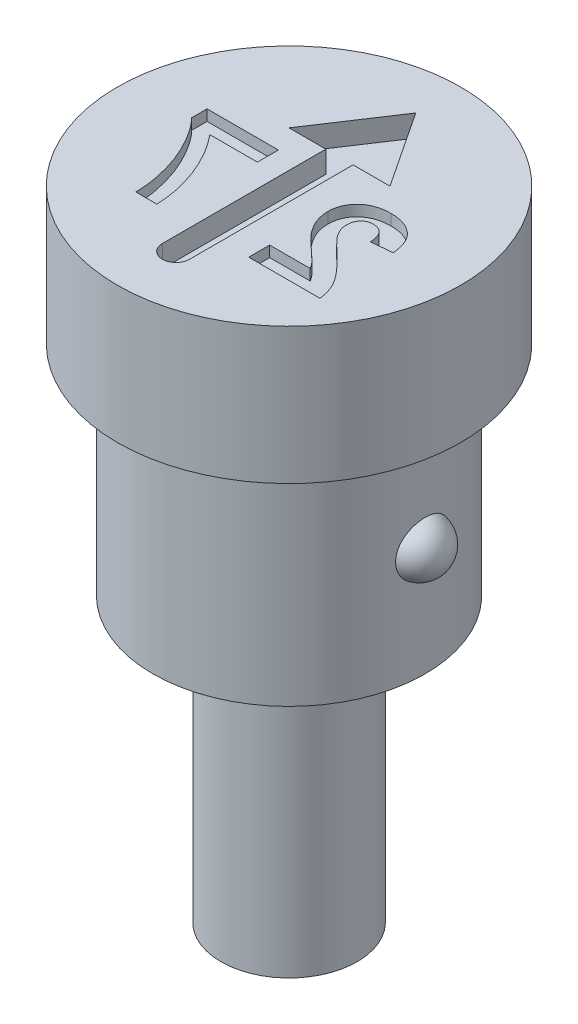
ISO-10303-21;
HEADER;
FILE_DESCRIPTION(('STEP AP214'),'2;1');
FILE_NAME('part.step','',(''),(''),'','','');
FILE_SCHEMA(('AUTOMOTIVE_DESIGN { 1 0 10303 214 1 1 1 1 }'));
ENDSEC;
DATA;
#1=APPLICATION_CONTEXT('core data for automotive mechanical design processes');
#2=APPLICATION_PROTOCOL_DEFINITION('international standard','automotive_design',2000,#1);
#3=PRODUCT_CONTEXT('',#1,'mechanical');
#4=PRODUCT('Part','Part','',(#3));
#5=PRODUCT_RELATED_PRODUCT_CATEGORY('part','',(#4));
#6=PRODUCT_DEFINITION_FORMATION('','',#4);
#7=PRODUCT_DEFINITION_CONTEXT('part definition',#1,'design');
#8=PRODUCT_DEFINITION('design','',#6,#7);
#9=PRODUCT_DEFINITION_SHAPE('','',#8);
#10=(LENGTH_UNIT() NAMED_UNIT(*) SI_UNIT(.MILLI.,.METRE.));
#11=(NAMED_UNIT(*) PLANE_ANGLE_UNIT() SI_UNIT($,.RADIAN.));
#12=(NAMED_UNIT(*) SI_UNIT($,.STERADIAN.) SOLID_ANGLE_UNIT());
#13=UNCERTAINTY_MEASURE_WITH_UNIT(LENGTH_MEASURE(1.E-05),#10,'distance_accuracy_value','');
#14=(GEOMETRIC_REPRESENTATION_CONTEXT(3) GLOBAL_UNCERTAINTY_ASSIGNED_CONTEXT((#13)) GLOBAL_UNIT_ASSIGNED_CONTEXT((#10,
#11,#12)) REPRESENTATION_CONTEXT('',''));
#15=CARTESIAN_POINT('',(0.,0.,0.));
#16=DIRECTION('',(0.,0.,1.));
#17=DIRECTION('',(1.,0.,0.));
#18=AXIS2_PLACEMENT_3D('',#15,#16,#17);
#19=CARTESIAN_POINT('',(0.,0.,0.));
#20=DIRECTION('',(0.,1.,0.));
#21=DIRECTION('',(0.,0.,1.));
#22=AXIS2_PLACEMENT_3D('',#19,#20,#21);
#23=CYLINDRICAL_SURFACE('',#22,2.5);
#24=CARTESIAN_POINT('',(0.,-2.5,0.));
#25=DIRECTION('',(0.,1.,0.));
#26=DIRECTION('',(0.,0.,1.));
#27=AXIS2_PLACEMENT_3D('',#24,#25,#26);
#28=CIRCLE('',#27,2.5);
#29=CARTESIAN_POINT('',(0.,-2.5,2.5));
#30=VERTEX_POINT('',#29);
#31=EDGE_CURVE('E416',#30,#30,#28,.T.);
#32=ORIENTED_EDGE('',*,*,#31,.F.);
#33=EDGE_LOOP('',(#32));
#34=FACE_BOUND('',#33,.T.);
#35=CARTESIAN_POINT('',(0.,-6.5,0.));
#36=DIRECTION('',(0.,1.,0.));
#37=DIRECTION('',(0.,0.,1.));
#38=AXIS2_PLACEMENT_3D('',#35,#36,#37);
#39=CIRCLE('',#38,2.5);
#40=CARTESIAN_POINT('',(0.,-6.5,2.5));
#41=VERTEX_POINT('',#40);
#42=EDGE_CURVE('E413',#41,#41,#39,.T.);
#43=ORIENTED_EDGE('',*,*,#42,.T.);
#44=EDGE_LOOP('',(#43));
#45=FACE_BOUND('',#44,.T.);
#46=CARTESIAN_POINT('',(2.45026890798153,-4.5,-0.496167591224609));
#47=CARTESIAN_POINT('',(2.45026941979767,-4.5268662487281,-0.496166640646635));
#48=CARTESIAN_POINT('',(2.45072698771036,-4.55374499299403,-0.493921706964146));
#49=CARTESIAN_POINT('',(2.45250670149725,-4.60674229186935,-0.485005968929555));
#50=CARTESIAN_POINT('',(2.45382952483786,-4.63286023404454,-0.478331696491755));
#51=CARTESIAN_POINT('',(2.45718801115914,-4.68356109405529,-0.460767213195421));
#52=CARTESIAN_POINT('',(2.45922301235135,-4.70814541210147,-0.449880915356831));
#53=CARTESIAN_POINT('',(2.46377966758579,-4.75513379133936,-0.424215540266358));
#54=CARTESIAN_POINT('',(2.4663012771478,-4.77753805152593,-0.409436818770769));
#55=CARTESIAN_POINT('',(2.47158882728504,-4.81984041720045,-0.37621026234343));
#56=CARTESIAN_POINT('',(2.47435731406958,-4.83970559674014,-0.357720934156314));
#57=CARTESIAN_POINT('',(2.47981238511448,-4.87611210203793,-0.317706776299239));
#58=CARTESIAN_POINT('',(2.48249896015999,-4.89265305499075,-0.296181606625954));
#59=CARTESIAN_POINT('',(2.48755477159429,-4.92230089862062,-0.250230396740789));
#60=CARTESIAN_POINT('',(2.48991659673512,-4.93533258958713,-0.225754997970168));
#61=CARTESIAN_POINT('',(2.49400144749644,-4.95719664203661,-0.174945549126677));
#62=CARTESIAN_POINT('',(2.49572443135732,-4.96602872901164,-0.148611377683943));
#63=CARTESIAN_POINT('',(2.49836056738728,-4.97935096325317,-0.0945245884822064));
#64=CARTESIAN_POINT('',(2.49926478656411,-4.9837932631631,-0.0667597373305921));
#65=CARTESIAN_POINT('',(2.50013265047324,-4.9880592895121,-0.0108628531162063));
#66=CARTESIAN_POINT('',(2.50009627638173,-4.98788292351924,0.0172691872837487));
#67=CARTESIAN_POINT('',(2.49908563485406,-4.98290967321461,0.0731754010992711));
#68=CARTESIAN_POINT('',(2.49810904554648,-4.97810135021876,0.100948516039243));
#69=CARTESIAN_POINT('',(2.49532150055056,-4.96396560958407,0.155276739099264));
#70=CARTESIAN_POINT('',(2.49351053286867,-4.95463812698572,0.18183182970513));
#71=CARTESIAN_POINT('',(2.48925506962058,-4.9317015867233,0.232953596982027));
#72=CARTESIAN_POINT('',(2.48681089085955,-4.91809466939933,0.257521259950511));
#73=CARTESIAN_POINT('',(2.48156118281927,-4.88694160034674,0.303975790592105));
#74=CARTESIAN_POINT('',(2.47875565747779,-4.8693954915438,0.325862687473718));
#75=CARTESIAN_POINT('',(2.47311801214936,-4.8309322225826,0.366197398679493));
#76=CARTESIAN_POINT('',(2.47028613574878,-4.81003489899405,0.384664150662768));
#77=CARTESIAN_POINT('',(2.4649055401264,-4.76536093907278,0.417759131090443));
#78=CARTESIAN_POINT('',(2.46235679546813,-4.74158456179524,0.432387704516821));
#79=CARTESIAN_POINT('',(2.45787929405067,-4.69223108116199,0.457149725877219));
#80=CARTESIAN_POINT('',(2.4559410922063,-4.66668972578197,0.467352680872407));
#81=CARTESIAN_POINT('',(2.4528552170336,-4.61420353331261,0.483288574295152));
#82=CARTESIAN_POINT('',(2.45170743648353,-4.58725888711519,0.489022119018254));
#83=CARTESIAN_POINT('',(2.4503523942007,-4.53332937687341,0.495766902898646));
#84=CARTESIAN_POINT('',(2.45012617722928,-4.5063568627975,0.496873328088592));
#85=CARTESIAN_POINT('',(2.45058785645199,-4.45261180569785,0.494591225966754));
#86=CARTESIAN_POINT('',(2.45127569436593,-4.4258392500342,0.491202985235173));
#87=CARTESIAN_POINT('',(2.4534773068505,-4.37348289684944,0.48008379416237));
#88=CARTESIAN_POINT('',(2.45498416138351,-4.34789106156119,0.472389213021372));
#89=CARTESIAN_POINT('',(2.45865144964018,-4.29836418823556,0.452913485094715));
#90=CARTESIAN_POINT('',(2.46081191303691,-4.27442922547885,0.441132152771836));
#91=CARTESIAN_POINT('',(2.46557820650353,-4.22858883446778,0.413666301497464));
#92=CARTESIAN_POINT('',(2.46818884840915,-4.20670975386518,0.397938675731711));
#93=CARTESIAN_POINT('',(2.47355408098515,-4.16585853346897,0.363097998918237));
#94=CARTESIAN_POINT('',(2.47630868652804,-4.14688669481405,0.343984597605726));
#95=CARTESIAN_POINT('',(2.48172468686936,-4.11195988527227,0.302471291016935));
#96=CARTESIAN_POINT('',(2.48438296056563,-4.09607570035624,0.280011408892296));
#97=CARTESIAN_POINT('',(2.48925607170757,-4.06821889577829,0.232740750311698));
#98=CARTESIAN_POINT('',(2.49147087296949,-4.05624659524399,0.207929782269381));
#99=CARTESIAN_POINT('',(2.49524821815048,-4.03635632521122,0.156258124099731));
#100=CARTESIAN_POINT('',(2.49680057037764,-4.02850130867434,0.129372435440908));
#101=CARTESIAN_POINT('',(2.49903554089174,-4.01731173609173,0.0746411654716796));
#102=CARTESIAN_POINT('',(2.49971812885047,-4.01397733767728,0.0467955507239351));
#103=CARTESIAN_POINT('',(2.50014060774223,-4.01190531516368,-0.00921056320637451));
#104=CARTESIAN_POINT('',(2.499875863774,-4.01319029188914,-0.0373719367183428));
#105=CARTESIAN_POINT('',(2.49842219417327,-4.02037605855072,-0.0930754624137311));
#106=CARTESIAN_POINT('',(2.49723325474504,-4.02627691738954,-0.120617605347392));
#107=CARTESIAN_POINT('',(2.49406090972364,-4.04255213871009,-0.174310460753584));
#108=CARTESIAN_POINT('',(2.49207720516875,-4.0529281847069,-0.200460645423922));
#109=CARTESIAN_POINT('',(2.48753466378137,-4.07789544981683,-0.250611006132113));
#110=CARTESIAN_POINT('',(2.48497583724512,-4.09248659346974,-0.27461122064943));
#111=CARTESIAN_POINT('',(2.47957795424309,-4.12546237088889,-0.319699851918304));
#112=CARTESIAN_POINT('',(2.4767397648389,-4.1438354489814,-0.34079681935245));
#113=CARTESIAN_POINT('',(2.47109866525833,-4.18392463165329,-0.37954675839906));
#114=CARTESIAN_POINT('',(2.46829575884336,-4.20564108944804,-0.39719936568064));
#115=CARTESIAN_POINT('',(2.4630825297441,-4.25154435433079,-0.428335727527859));
#116=CARTESIAN_POINT('',(2.46066796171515,-4.27569895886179,-0.441866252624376));
#117=CARTESIAN_POINT('',(2.45647527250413,-4.32599598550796,-0.464611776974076));
#118=CARTESIAN_POINT('',(2.45469654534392,-4.35213648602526,-0.473830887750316));
#119=CARTESIAN_POINT('',(2.4523384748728,-4.39862136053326,-0.485862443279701));
#120=CARTESIAN_POINT('',(2.45156706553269,-4.41869210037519,-0.489720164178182));
#121=CARTESIAN_POINT('',(2.45053209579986,-4.45917282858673,-0.494873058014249));
#122=CARTESIAN_POINT('',(2.45026851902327,-4.4795828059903,-0.496168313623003));
#123=CARTESIAN_POINT('',(2.45026890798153,-4.5,-0.496167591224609));
#124=B_SPLINE_CURVE_WITH_KNOTS('',3,(#46,#47,#48,#49,#50,#51,#52,#53,#54,#55,#56,#57,#58,#59,
#60,#61,#62,#63,#64,#65,#66,#67,#68,#69,#70,#71,#72,#73,#74,#75,#76,#77,#78,#79,#80,#81,#82,#83,
#84,#85,#86,#87,#88,#89,#90,#91,#92,#93,#94,#95,#96,#97,#98,#99,#100,#101,#102,#103,#104,#105,
#106,#107,#108,#109,#110,#111,#112,#113,#114,#115,#116,#117,#118,#119,#120,#121,#122,#123),
.UNSPECIFIED.,.T.,.F.,(4,2,2,2,2,2,2,2,2,2,2,2,2,2,2,2,2,2,2,2,2,2,2,2,2,2,2,2,2,2,2,2,2,2,2,2,
2,2,4),(0.,0.0805239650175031,0.161111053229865,0.241623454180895,0.322128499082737,
0.403589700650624,0.485060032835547,0.568157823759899,0.651261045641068,0.735260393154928,
0.819261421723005,0.903470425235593,0.987680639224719,1.07184880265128,1.15601604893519,
1.23970232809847,1.32338108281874,1.40569330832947,1.48799436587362,1.56859379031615,
1.64918807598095,1.72911175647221,1.80903906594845,1.88988066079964,1.97073062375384,
2.05325859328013,2.13579329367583,2.21955561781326,2.30332086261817,2.38749649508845,
2.4716733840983,2.55588196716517,2.64008904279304,2.72404254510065,2.80800492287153,
2.89097573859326,2.97386726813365,3.03506399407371,3.09625874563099),.UNSPECIFIED.);
#125=CARTESIAN_POINT('',(2.45026890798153,-4.5,-0.496167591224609));
#126=VERTEX_POINT('',#125);
#127=EDGE_CURVE('E41',#126,#126,#124,.T.);
#128=ORIENTED_EDGE('',*,*,#127,.T.);
#129=EDGE_LOOP('',(#128));
#130=FACE_BOUND('',#129,.T.);
#131=ADVANCED_FACE('F37',(#34,#45,#130),#23,.T.);
#132=CARTESIAN_POINT('',(0.,0.,0.));
#133=DIRECTION('',(0.,1.,0.));
#134=DIRECTION('',(0.,0.,1.));
#135=AXIS2_PLACEMENT_3D('',#132,#133,#134);
#136=PLANE('',#135);
#137=DIRECTION('',(-1.,0.,0.));
#138=VECTOR('',#137,1.);
#139=CARTESIAN_POINT('',(1.50238477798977,0.,1.11435643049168));
#140=LINE('',#139,#138);
#141=CARTESIAN_POINT('',(1.50238477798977,0.,1.11435643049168));
#142=VERTEX_POINT('',#141);
#143=CARTESIAN_POINT('',(0.759195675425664,0.,1.11435643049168));
#144=VERTEX_POINT('',#143);
#145=EDGE_CURVE('E58',#142,#144,#140,.T.);
#146=ORIENTED_EDGE('',*,*,#145,.F.);
#147=CARTESIAN_POINT('',(0.953105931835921,0.,0.544644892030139));
#148=CARTESIAN_POINT('',(0.959189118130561,0.,0.552306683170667));
#149=CARTESIAN_POINT('',(0.972217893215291,0.,0.568716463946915));
#150=CARTESIAN_POINT('',(0.994383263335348,0.,0.593878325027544));
#151=CARTESIAN_POINT('',(1.0200710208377,0.,0.621363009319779));
#152=CARTESIAN_POINT('',(1.04891833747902,0.,0.651684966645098));
#153=CARTESIAN_POINT('',(1.08187809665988,0.,0.68377041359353));
#154=CARTESIAN_POINT('',(1.11776440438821,0.,0.718961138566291));
#155=CARTESIAN_POINT('',(1.15815636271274,0.,0.755457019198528));
#156=CARTESIAN_POINT('',(1.19999264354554,0.,0.794168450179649));
#157=CARTESIAN_POINT('',(1.24201077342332,0.,0.83184574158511));
#158=CARTESIAN_POINT('',(1.28063149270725,0.,0.867630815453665));
#159=CARTESIAN_POINT('',(1.31571195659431,0.,0.899292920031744));
#160=CARTESIAN_POINT('',(1.34561840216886,0.,0.928579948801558));
#161=CARTESIAN_POINT('',(1.37210991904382,0.,0.953493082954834));
#162=CARTESIAN_POINT('',(1.3942316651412,0.,0.975309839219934));
#163=CARTESIAN_POINT('',(1.41239759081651,0.,0.993502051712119));
#164=CARTESIAN_POINT('',(1.43742906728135,0.,1.02185909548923));
#165=CARTESIAN_POINT('',(1.46927878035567,0.,1.06021200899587));
#166=CARTESIAN_POINT('',(1.49168635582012,0.,1.09685930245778));
#167=CARTESIAN_POINT('',(1.50238477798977,0.,1.11435643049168));
#168=B_SPLINE_CURVE_WITH_KNOTS('',3,(#147,#148,#149,#150,#151,#152,#153,#154,#155,#156,#157,
#158,#159,#160,#161,#162,#163,#164,#165,#166,#167),.UNSPECIFIED.,.F.,.F.,(4,1,1,1,1,1,1,1,1,1,1,
1,1,1,1,1,1,1,4),(0.,0.0369753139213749,0.0791925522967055,0.126700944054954,0.179184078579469,
0.23736864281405,0.300558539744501,0.369153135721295,0.443112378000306,0.516018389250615,
0.582473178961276,0.642136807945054,0.694619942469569,0.740679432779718,0.779589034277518,
0.812073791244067,0.837814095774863,0.922564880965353,1.),.UNSPECIFIED.);
#169=CARTESIAN_POINT('',(0.953105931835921,0.,0.544644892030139));
#170=VERTEX_POINT('',#169);
#171=EDGE_CURVE('E243',#170,#142,#168,.T.);
#172=ORIENTED_EDGE('',*,*,#171,.F.);
#173=CARTESIAN_POINT('',(0.759195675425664,0.,0.0430423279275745));
#174=CARTESIAN_POINT('',(0.759684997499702,0.,0.0648432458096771));
#175=CARTESIAN_POINT('',(0.760655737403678,0.,0.108092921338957));
#176=CARTESIAN_POINT('',(0.769949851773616,0.,0.172028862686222));
#177=CARTESIAN_POINT('',(0.784149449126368,0.,0.234490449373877));
#178=CARTESIAN_POINT('',(0.80513533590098,0.,0.295630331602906));
#179=CARTESIAN_POINT('',(0.831736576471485,0.,0.356915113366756));
#180=CARTESIAN_POINT('',(0.866026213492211,0.,0.418482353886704));
#181=CARTESIAN_POINT('',(0.905839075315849,0.,0.482188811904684));
#182=CARTESIAN_POINT('',(0.937010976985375,0.,0.523377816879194));
#183=CARTESIAN_POINT('',(0.953105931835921,0.,0.544644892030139));
#184=B_SPLINE_CURVE_WITH_KNOTS('',3,(#173,#174,#175,#176,#177,#178,#179,#180,#181,#182,#183),
.UNSPECIFIED.,.F.,.F.,(4,1,1,1,1,1,1,1,4),(0.,0.119176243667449,0.236427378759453,
0.352663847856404,0.469086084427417,0.589462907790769,0.717601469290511,0.854189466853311,1.),.UNSPECIFIED.);
#185=CARTESIAN_POINT('',(0.759195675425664,0.,0.0430423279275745));
#186=VERTEX_POINT('',#185);
#187=EDGE_CURVE('E246',#186,#170,#184,.T.);
#188=ORIENTED_EDGE('',*,*,#187,.F.);
#189=CARTESIAN_POINT('',(1.37297772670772,0.,-0.501028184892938));
#190=CARTESIAN_POINT('',(1.34972334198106,0.,-0.500581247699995));
#191=CARTESIAN_POINT('',(1.30443250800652,0.,-0.499710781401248));
#192=CARTESIAN_POINT('',(1.23831593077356,0.,-0.492522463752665));
#193=CARTESIAN_POINT('',(1.17620415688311,0.,-0.479988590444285));
#194=CARTESIAN_POINT('',(1.11755416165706,0.,-0.463385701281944));
#195=CARTESIAN_POINT('',(1.0629682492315,0.,-0.441219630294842));
#196=CARTESIAN_POINT('',(1.01199155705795,0.,-0.414421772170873));
#197=CARTESIAN_POINT('',(0.965426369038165,0.,-0.381975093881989));
#198=CARTESIAN_POINT('',(0.922578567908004,0.,-0.345649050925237));
#199=CARTESIAN_POINT('',(0.884276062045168,0.,-0.305702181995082));
#200=CARTESIAN_POINT('',(0.850726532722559,0.,-0.263092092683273));
#201=CARTESIAN_POINT('',(0.822618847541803,0.,-0.217848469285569));
#202=CARTESIAN_POINT('',(0.799032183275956,0.,-0.170522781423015));
#203=CARTESIAN_POINT('',(0.781519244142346,0.,-0.120353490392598));
#204=CARTESIAN_POINT('',(0.768758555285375,0.,-0.0680342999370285));
#205=CARTESIAN_POINT('',(0.760297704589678,0.,-0.0133211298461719));
#206=CARTESIAN_POINT('',(0.75956708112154,0.,0.024046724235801));
#207=CARTESIAN_POINT('',(0.759195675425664,0.,0.0430423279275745));
#208=B_SPLINE_CURVE_WITH_KNOTS('',3,(#189,#190,#191,#192,#193,#194,#195,#196,#197,#198,#199,
#200,#201,#202,#203,#204,#205,#206,#207),.UNSPECIFIED.,.F.,.F.,(4,1,1,1,1,1,1,1,1,1,1,1,1,1,1,1,
4),(0.,0.0756723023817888,0.147381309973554,0.216084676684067,0.28169803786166,
0.345459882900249,0.407485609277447,0.46873129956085,0.529782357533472,0.590032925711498,
0.648548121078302,0.70595351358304,0.763101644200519,0.820289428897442,0.878479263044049,
0.938226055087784,1.),.UNSPECIFIED.);
#209=CARTESIAN_POINT('',(1.37297772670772,0.,-0.501028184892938));
#210=VERTEX_POINT('',#209);
#211=EDGE_CURVE('E552',#210,#186,#208,.T.);
#212=ORIENTED_EDGE('',*,*,#211,.F.);
#213=CARTESIAN_POINT('',(2.01560593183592,0.,0.102337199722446));
#214=CARTESIAN_POINT('',(2.01251368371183,0.,0.0763708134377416));
#215=CARTESIAN_POINT('',(2.00651830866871,0.,0.0260261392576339));
#216=CARTESIAN_POINT('',(1.99155674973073,0.,-0.0462861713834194));
#217=CARTESIAN_POINT('',(1.97260848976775,0.,-0.112997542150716));
#218=CARTESIAN_POINT('',(1.94877020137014,0.,-0.173984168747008));
#219=CARTESIAN_POINT('',(1.92102714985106,0.,-0.229633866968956));
#220=CARTESIAN_POINT('',(1.88796420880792,0.,-0.279111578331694));
#221=CARTESIAN_POINT('',(1.85073663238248,0.,-0.322965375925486));
#222=CARTESIAN_POINT('',(1.80931224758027,0.,-0.361171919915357));
#223=CARTESIAN_POINT('',(1.76395440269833,0.,-0.39385275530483));
#224=CARTESIAN_POINT('',(1.71635948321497,0.,-0.423025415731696));
#225=CARTESIAN_POINT('',(1.6655973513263,0.,-0.446956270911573));
#226=CARTESIAN_POINT('',(1.61222689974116,0.,-0.466678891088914));
#227=CARTESIAN_POINT('',(1.5562722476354,0.,-0.482441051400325));
#228=CARTESIAN_POINT('',(1.49747459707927,0.,-0.492862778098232));
#229=CARTESIAN_POINT('',(1.43619682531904,0.,-0.500193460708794));
#230=CARTESIAN_POINT('',(1.39436836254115,0.,-0.500745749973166));
#231=CARTESIAN_POINT('',(1.37297772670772,0.,-0.501028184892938));
#232=B_SPLINE_CURVE_WITH_KNOTS('',3,(#213,#214,#215,#216,#217,#218,#219,#220,#221,#222,#223,
#224,#225,#226,#227,#228,#229,#230,#231),.UNSPECIFIED.,.F.,.F.,(4,1,1,1,1,1,1,1,1,1,1,1,1,1,1,1,
4),(0.,0.0794357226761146,0.154013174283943,0.224141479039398,0.289934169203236,
0.352732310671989,0.41272577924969,0.470302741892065,0.527168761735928,0.583502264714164,
0.639948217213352,0.696584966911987,0.753726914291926,0.812707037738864,0.872963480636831,
0.93503486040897,1.),.UNSPECIFIED.);
#233=CARTESIAN_POINT('',(2.01560593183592,0.,0.102337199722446));
#234=VERTEX_POINT('',#233);
#235=EDGE_CURVE('E560',#234,#210,#232,.T.);
#236=ORIENTED_EDGE('',*,*,#235,.F.);
#237=DIRECTION('',(0.995240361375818,0.,-0.0974506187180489));
#238=VECTOR('',#237,1.);
#239=CARTESIAN_POINT('',(1.63099054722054,0.,0.139997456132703));
#240=LINE('',#239,#238);
#241=CARTESIAN_POINT('',(1.63099054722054,0.,0.139997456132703));
#242=VERTEX_POINT('',#241);
#243=EDGE_CURVE('E568',#242,#234,#240,.T.);
#244=ORIENTED_EDGE('',*,*,#243,.F.);
#245=CARTESIAN_POINT('',(1.38099054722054,0.,-0.167694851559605));
#246=CARTESIAN_POINT('',(1.3984350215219,0.,-0.16690450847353));
#247=CARTESIAN_POINT('',(1.43213397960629,0.,-0.16537773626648));
#248=CARTESIAN_POINT('',(1.48002751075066,0.,-0.152040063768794));
#249=CARTESIAN_POINT('',(1.52192551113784,0.,-0.12895114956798));
#250=CARTESIAN_POINT('',(1.55178425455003,0.,-0.102639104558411));
#251=CARTESIAN_POINT('',(1.57195525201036,0.,-0.0770525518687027));
#252=CARTESIAN_POINT('',(1.58569906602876,0.,-0.0547555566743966));
#253=CARTESIAN_POINT('',(1.59754516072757,0.,-0.0294193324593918));
#254=CARTESIAN_POINT('',(1.60804178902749,0.,-0.00132912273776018));
#255=CARTESIAN_POINT('',(1.61633293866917,0.,0.029836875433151));
#256=CARTESIAN_POINT('',(1.62301011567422,0.,0.0638413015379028));
#257=CARTESIAN_POINT('',(1.62839095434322,0.,0.100867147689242));
#258=CARTESIAN_POINT('',(1.63010215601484,0.,0.126624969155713));
#259=CARTESIAN_POINT('',(1.63099054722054,0.,0.139997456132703));
#260=B_SPLINE_CURVE_WITH_KNOTS('',3,(#245,#246,#247,#248,#249,#250,#251,#252,#253,#254,#255,
#256,#257,#258,#259),.UNSPECIFIED.,.F.,.F.,(4,1,1,1,1,1,1,1,1,1,1,1,4),(0.,0.116899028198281,
0.225823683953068,0.330086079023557,0.435451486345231,0.490306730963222,0.548244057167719,
0.610766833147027,0.677675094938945,0.749188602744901,0.826858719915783,0.910111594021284,1.),.UNSPECIFIED.);
#261=CARTESIAN_POINT('',(1.38099054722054,0.,-0.167694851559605));
#262=VERTEX_POINT('',#261);
#263=EDGE_CURVE('E574',#262,#242,#260,.T.);
#264=ORIENTED_EDGE('',*,*,#263,.F.);
#265=CARTESIAN_POINT('',(1.14381106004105,0.,0.0947250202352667));
#266=CARTESIAN_POINT('',(1.14453139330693,0.,0.0747702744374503));
#267=CARTESIAN_POINT('',(1.14589420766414,0.,0.0370174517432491));
#268=CARTESIAN_POINT('',(1.15732164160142,0.,-0.016258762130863));
#269=CARTESIAN_POINT('',(1.17758634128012,0.,-0.0620572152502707));
#270=CARTESIAN_POINT('',(1.20548710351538,0.,-0.100518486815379));
#271=CARTESIAN_POINT('',(1.24076767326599,0.,-0.130652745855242));
#272=CARTESIAN_POINT('',(1.28201168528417,0.,-0.152919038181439));
#273=CARTESIAN_POINT('',(1.32982288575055,0.,-0.165229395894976));
#274=CARTESIAN_POINT('',(1.36342741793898,0.,-0.166848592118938));
#275=CARTESIAN_POINT('',(1.38099054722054,0.,-0.167694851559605));
#276=B_SPLINE_CURVE_WITH_KNOTS('',3,(#265,#266,#267,#268,#269,#270,#271,#272,#273,#274,#275),
.UNSPECIFIED.,.F.,.F.,(4,1,1,1,1,1,1,1,4),(0.,0.149140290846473,0.282161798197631,
0.404655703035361,0.521109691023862,0.634416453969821,0.748796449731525,0.868710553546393,1.),.UNSPECIFIED.);
#277=CARTESIAN_POINT('',(1.14381106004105,0.,0.0947250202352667));
#278=VERTEX_POINT('',#277);
#279=EDGE_CURVE('E579',#278,#262,#276,.T.);
#280=ORIENTED_EDGE('',*,*,#279,.F.);
#281=CARTESIAN_POINT('',(1.21993285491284,0.,0.325894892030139));
#282=CARTESIAN_POINT('',(1.2083529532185,0.,0.306659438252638));
#283=CARTESIAN_POINT('',(1.18601666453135,0.,0.2695564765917));
#284=CARTESIAN_POINT('',(1.16152307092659,0.,0.211211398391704));
#285=CARTESIAN_POINT('',(1.14682110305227,0.,0.152878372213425));
#286=CARTESIAN_POINT('',(1.14480359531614,0.,0.113900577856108));
#287=CARTESIAN_POINT('',(1.14381106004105,0.,0.0947250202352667));
#288=B_SPLINE_CURVE_WITH_KNOTS('',3,(#281,#282,#283,#284,#285,#286,#287),.UNSPECIFIED.,.F.,.F.,
(4,1,1,1,4),(0.,0.272795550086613,0.526191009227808,0.766904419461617,1.),.UNSPECIFIED.);
#289=CARTESIAN_POINT('',(1.21993285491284,0.,0.325894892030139));
#290=VERTEX_POINT('',#289);
#291=EDGE_CURVE('E587',#290,#278,#288,.T.);
#292=ORIENTED_EDGE('',*,*,#291,.F.);
#293=CARTESIAN_POINT('',(1.52602259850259,0.,0.648811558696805));
#294=CARTESIAN_POINT('',(1.50624853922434,0.,0.629724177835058));
#295=CARTESIAN_POINT('',(1.46860455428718,0.,0.593387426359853));
#296=CARTESIAN_POINT('',(1.41499944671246,0.,0.54135467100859));
#297=CARTESIAN_POINT('',(1.36787503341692,0.,0.493521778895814));
#298=CARTESIAN_POINT('',(1.32624600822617,0.,0.451128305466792));
#299=CARTESIAN_POINT('',(1.29107406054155,0.,0.4130948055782));
#300=CARTESIAN_POINT('',(1.26189653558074,0.,0.380018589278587));
#301=CARTESIAN_POINT('',(1.23834390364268,0.,0.351764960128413));
#302=CARTESIAN_POINT('',(1.22558777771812,0.,0.333840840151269));
#303=CARTESIAN_POINT('',(1.21993285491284,0.,0.325894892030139));
#304=B_SPLINE_CURVE_WITH_KNOTS('',3,(#293,#294,#295,#296,#297,#298,#299,#300,#301,#302,#303),
.UNSPECIFIED.,.F.,.F.,(4,1,1,1,1,1,1,1,4),(0.,0.18509006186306,0.352356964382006,
0.503079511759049,0.637279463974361,0.752473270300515,0.851885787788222,0.934339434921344,1.),.UNSPECIFIED.);
#305=CARTESIAN_POINT('',(1.52602259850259,0.,0.648811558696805));
#306=VERTEX_POINT('',#305);
#307=EDGE_CURVE('E595',#306,#290,#304,.T.);
#308=ORIENTED_EDGE('',*,*,#307,.F.);
#309=CARTESIAN_POINT('',(2.06688798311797,0.,1.49897181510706));
#310=CARTESIAN_POINT('',(2.06246043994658,0.,1.46610085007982));
#311=CARTESIAN_POINT('',(2.05360783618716,0.,1.40037735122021));
#312=CARTESIAN_POINT('',(2.02623875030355,0.,1.30437186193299));
#313=CARTESIAN_POINT('',(1.98971039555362,0.,1.21068690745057));
#314=CARTESIAN_POINT('',(1.9500658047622,0.,1.13445009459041));
#315=CARTESIAN_POINT('',(1.91063486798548,0.,1.0730820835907));
#316=CARTESIAN_POINT('',(1.87485917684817,0.,1.02279666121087));
#317=CARTESIAN_POINT('',(1.83218009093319,0.,0.969295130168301));
#318=CARTESIAN_POINT('',(1.7832169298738,0.,0.912145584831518));
#319=CARTESIAN_POINT('',(1.72824028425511,0.,0.851169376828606));
#320=CARTESIAN_POINT('',(1.66683999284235,0.,0.786593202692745));
#321=CARTESIAN_POINT('',(1.59872316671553,0.,0.718726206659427));
#322=CARTESIAN_POINT('',(1.55080176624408,0.,0.672641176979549));
#323=CARTESIAN_POINT('',(1.52602259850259,0.,0.648811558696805));
#324=B_SPLINE_CURVE_WITH_KNOTS('',3,(#309,#310,#311,#312,#313,#314,#315,#316,#317,#318,#319,
#320,#321,#322,#323),.UNSPECIFIED.,.F.,.F.,(4,1,1,1,1,1,1,1,1,1,1,1,4),(0.,0.0963574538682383,
0.192660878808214,0.289454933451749,0.388479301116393,0.441921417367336,0.501521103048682,
0.567882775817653,0.640891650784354,0.72037065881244,0.806636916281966,0.900015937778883,1.),.UNSPECIFIED.);
#325=CARTESIAN_POINT('',(2.06688798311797,0.,1.49897181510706));
#326=VERTEX_POINT('',#325);
#327=EDGE_CURVE('E603',#326,#306,#324,.T.);
#328=ORIENTED_EDGE('',*,*,#327,.F.);
#329=DIRECTION('',(1.,0.,0.));
#330=VECTOR('',#329,1.);
#331=CARTESIAN_POINT('',(0.759195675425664,0.,1.49897181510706));
#332=LINE('',#331,#330);
#333=CARTESIAN_POINT('',(0.759195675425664,0.,1.49897181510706));
#334=VERTEX_POINT('',#333);
#335=EDGE_CURVE('E611',#334,#326,#332,.T.);
#336=ORIENTED_EDGE('',*,*,#335,.F.);
#337=DIRECTION('',(0.,0.,1.));
#338=VECTOR('',#337,1.);
#339=CARTESIAN_POINT('',(0.759195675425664,0.,1.11435643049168));
#340=LINE('',#339,#338);
#341=EDGE_CURVE('E617',#144,#334,#340,.T.);
#342=ORIENTED_EDGE('',*,*,#341,.F.);
#343=EDGE_LOOP('',(#146,#172,#188,#212,#236,#244,#264,#280,#292,#308,#328,#336,#342));
#344=FACE_BOUND('',#343,.T.);
#345=DIRECTION('',(1.,0.,0.));
#346=VECTOR('',#345,1.);
#347=CARTESIAN_POINT('',(-1.54376906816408,0.,-0.0907717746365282));
#348=LINE('',#347,#346);
#349=CARTESIAN_POINT('',(-1.54376906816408,0.,-0.0907717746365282));
#350=VERTEX_POINT('',#349);
#351=CARTESIAN_POINT('',(-0.671573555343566,0.,-0.0907717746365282));
#352=VERTEX_POINT('',#351);
#353=EDGE_CURVE('E66',#350,#352,#348,.T.);
#354=ORIENTED_EDGE('',*,*,#353,.F.);
#355=CARTESIAN_POINT('',(-0.927983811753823,0.,1.49897181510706));
#356=CARTESIAN_POINT('',(-0.929269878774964,0.,1.46489940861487));
#357=CARTESIAN_POINT('',(-0.931856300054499,0.,1.39637607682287));
#358=CARTESIAN_POINT('',(-0.941533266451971,0.,1.29352479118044));
#359=CARTESIAN_POINT('',(-0.956731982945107,0.,1.19029053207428));
#360=CARTESIAN_POINT('',(-0.975609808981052,0.,1.08643470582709));
#361=CARTESIAN_POINT('',(-1.00053324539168,0.,0.982210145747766));
#362=CARTESIAN_POINT('',(-1.0289785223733,0.,0.87723077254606));
#363=CARTESIAN_POINT('',(-1.06343569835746,0.,0.772057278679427));
#364=CARTESIAN_POINT('',(-1.10206126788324,0.,0.666890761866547));
#365=CARTESIAN_POINT('',(-1.14470186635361,0.,0.562729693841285));
#366=CARTESIAN_POINT('',(-1.19117411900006,0.,0.460866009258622));
#367=CARTESIAN_POINT('',(-1.24135789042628,0.,0.361935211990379));
#368=CARTESIAN_POINT('',(-1.29460055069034,0.,0.265589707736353));
#369=CARTESIAN_POINT('',(-1.35152150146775,0.,0.172139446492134));
#370=CARTESIAN_POINT('',(-1.41216359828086,0.,0.0816859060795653));
#371=CARTESIAN_POINT('',(-1.47566664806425,0.,-0.00642522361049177));
#372=CARTESIAN_POINT('',(-1.5210720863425,0.,-0.0626609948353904));
#373=CARTESIAN_POINT('',(-1.54376906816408,0.,-0.0907717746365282));
#374=B_SPLINE_CURVE_WITH_KNOTS('',3,(#355,#356,#357,#358,#359,#360,#361,#362,#363,#364,#365,
#366,#367,#368,#369,#370,#371,#372,#373),.UNSPECIFIED.,.F.,.F.,(4,1,1,1,1,1,1,1,1,1,1,1,1,1,1,1,
4),(0.,0.0589531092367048,0.118561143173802,0.178522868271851,0.239353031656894,
0.301026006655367,0.363773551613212,0.427382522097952,0.492333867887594,0.557475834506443,
0.621960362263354,0.685889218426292,0.749254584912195,0.812267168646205,0.875035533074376,
0.937533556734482,1.),.UNSPECIFIED.);
#375=CARTESIAN_POINT('',(-0.927983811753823,0.,1.49897181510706));
#376=VERTEX_POINT('',#375);
#377=EDGE_CURVE('E328',#376,#350,#374,.T.);
#378=ORIENTED_EDGE('',*,*,#377,.F.);
#379=DIRECTION('',(1.,0.,0.));
#380=VECTOR('',#379,1.);
#381=CARTESIAN_POINT('',(-1.31259919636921,0.,1.49897181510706));
#382=LINE('',#381,#380);
#383=CARTESIAN_POINT('',(-1.31259919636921,0.,1.49897181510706));
#384=VERTEX_POINT('',#383);
#385=EDGE_CURVE('E322',#384,#376,#382,.T.);
#386=ORIENTED_EDGE('',*,*,#385,.F.);
#387=CARTESIAN_POINT('',(-1.97926586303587,0.,-0.193335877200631));
#388=CARTESIAN_POINT('',(-1.96562416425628,0.,-0.179455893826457));
#389=CARTESIAN_POINT('',(-1.93758075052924,0.,-0.150922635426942));
#390=CARTESIAN_POINT('',(-1.89741130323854,0.,-0.104225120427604));
#391=CARTESIAN_POINT('',(-1.85664669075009,0.,-0.0535501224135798));
#392=CARTESIAN_POINT('',(-1.81613934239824,0.,0.00178520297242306));
#393=CARTESIAN_POINT('',(-1.77463010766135,0.,0.0609067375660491));
#394=CARTESIAN_POINT('',(-1.73394317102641,0.,0.124947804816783));
#395=CARTESIAN_POINT('',(-1.69267751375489,0.,0.193077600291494));
#396=CARTESIAN_POINT('',(-1.63712089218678,0.,0.289447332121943));
#397=CARTESIAN_POINT('',(-1.57218213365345,0.,0.415335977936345));
#398=CARTESIAN_POINT('',(-1.50348036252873,0.,0.571821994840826));
#399=CARTESIAN_POINT('',(-1.44494959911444,0.,0.733113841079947));
#400=CARTESIAN_POINT('',(-1.40487030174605,0.,0.870546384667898));
#401=CARTESIAN_POINT('',(-1.37779028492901,0.,0.980698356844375));
#402=CARTESIAN_POINT('',(-1.36009751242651,0.,1.06124408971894));
#403=CARTESIAN_POINT('',(-1.34520395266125,0.,1.13952316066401));
#404=CARTESIAN_POINT('',(-1.33308805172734,0.,1.21567314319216));
#405=CARTESIAN_POINT('',(-1.32404561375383,0.,1.28972877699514));
#406=CARTESIAN_POINT('',(-1.31690054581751,0.,1.36143259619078));
#407=CARTESIAN_POINT('',(-1.31337547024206,0.,1.4309594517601));
#408=CARTESIAN_POINT('',(-1.31285530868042,0.,1.47653282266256));
#409=CARTESIAN_POINT('',(-1.31259919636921,0.,1.49897181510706));
#410=B_SPLINE_CURVE_WITH_KNOTS('',3,(#387,#388,#389,#390,#391,#392,#393,#394,#395,#396,#397,
#398,#399,#400,#401,#402,#403,#404,#405,#406,#407,#408,#409),.UNSPECIFIED.,.F.,.F.,(4,1,1,1,1,1,
1,1,1,1,1,1,1,1,1,1,1,1,1,1,4),(0.,0.0314272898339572,0.0646054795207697,0.0994393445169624,
0.136456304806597,0.175351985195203,0.216100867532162,0.258977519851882,0.304007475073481,
0.395756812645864,0.487615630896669,0.579873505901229,0.672707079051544,0.718694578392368,
0.76307923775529,0.80589344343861,0.847386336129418,0.88760014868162,0.926386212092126,
0.963754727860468,1.),.UNSPECIFIED.);
#411=CARTESIAN_POINT('',(-1.97926586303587,0.,-0.193335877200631));
#412=VERTEX_POINT('',#411);
#413=EDGE_CURVE('E317',#412,#384,#410,.T.);
#414=ORIENTED_EDGE('',*,*,#413,.F.);
#415=DIRECTION('',(0.,0.,1.));
#416=VECTOR('',#415,1.);
#417=CARTESIAN_POINT('',(-1.97926586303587,0.,-0.475387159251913));
#418=LINE('',#417,#416);
#419=CARTESIAN_POINT('',(-1.97926586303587,0.,-0.475387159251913));
#420=VERTEX_POINT('',#419);
#421=EDGE_CURVE('E314',#420,#412,#418,.T.);
#422=ORIENTED_EDGE('',*,*,#421,.F.);
#423=DIRECTION('',(-1.,0.,0.));
#424=VECTOR('',#423,1.);
#425=CARTESIAN_POINT('',(-0.671573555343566,0.,-0.475387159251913));
#426=LINE('',#425,#424);
#427=CARTESIAN_POINT('',(-0.671573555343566,0.,-0.475387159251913));
#428=VERTEX_POINT('',#427);
#429=EDGE_CURVE('E311',#428,#420,#426,.T.);
#430=ORIENTED_EDGE('',*,*,#429,.F.);
#431=DIRECTION('',(0.,0.,-1.));
#432=VECTOR('',#431,1.);
#433=CARTESIAN_POINT('',(-0.671573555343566,0.,-0.0907717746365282));
#434=LINE('',#433,#432);
#435=EDGE_CURVE('E308',#352,#428,#434,.T.);
#436=ORIENTED_EDGE('',*,*,#435,.F.);
#437=EDGE_LOOP('',(#354,#378,#386,#414,#422,#430,#436));
#438=FACE_BOUND('',#437,.T.);
#439=DIRECTION('',(-0.551936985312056,0.,-0.833885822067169));
#440=VECTOR('',#439,1.);
#441=CARTESIAN_POINT('',(0.926639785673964,0.,-0.925));
#442=LINE('',#441,#440);
#443=CARTESIAN_POINT('',(0.926639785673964,0.,-0.925));
#444=VERTEX_POINT('',#443);
#445=CARTESIAN_POINT('',(0.,0.,-2.325));
#446=VERTEX_POINT('',#445);
#447=EDGE_CURVE('E373',#444,#446,#442,.T.);
#448=ORIENTED_EDGE('',*,*,#447,.F.);
#449=DIRECTION('',(1.,0.,0.));
#450=VECTOR('',#449,1.);
#451=CARTESIAN_POINT('',(0.25,0.,-0.925));
#452=LINE('',#451,#450);
#453=CARTESIAN_POINT('',(0.25,0.,-0.925));
#454=VERTEX_POINT('',#453);
#455=EDGE_CURVE('E354',#454,#444,#452,.T.);
#456=ORIENTED_EDGE('',*,*,#455,.F.);
#457=DIRECTION('',(0.,0.,-1.));
#458=VECTOR('',#457,1.);
#459=CARTESIAN_POINT('',(0.250000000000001,0.,2.075));
#460=LINE('',#459,#458);
#461=CARTESIAN_POINT('',(0.250000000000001,0.,2.075));
#462=VERTEX_POINT('',#461);
#463=EDGE_CURVE('E388',#462,#454,#460,.T.);
#464=ORIENTED_EDGE('',*,*,#463,.F.);
#465=CARTESIAN_POINT('',(0.,0.,2.075));
#466=DIRECTION('',(0.,1.,0.));
#467=DIRECTION('',(0.,0.,1.));
#468=AXIS2_PLACEMENT_3D('',#465,#466,#467);
#469=CIRCLE('',#468,0.250000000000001);
#470=CARTESIAN_POINT('',(-0.250000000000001,0.,2.075));
#471=VERTEX_POINT('',#470);
#472=EDGE_CURVE('E385',#471,#462,#469,.T.);
#473=ORIENTED_EDGE('',*,*,#472,.F.);
#474=DIRECTION('',(0.,0.,1.));
#475=VECTOR('',#474,1.);
#476=CARTESIAN_POINT('',(-0.250000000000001,0.,-0.925));
#477=LINE('',#476,#475);
#478=CARTESIAN_POINT('',(-0.250000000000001,0.,-0.925));
#479=VERTEX_POINT('',#478);
#480=EDGE_CURVE('E382',#479,#471,#477,.T.);
#481=ORIENTED_EDGE('',*,*,#480,.F.);
#482=DIRECTION('',(1.,0.,0.));
#483=VECTOR('',#482,1.);
#484=CARTESIAN_POINT('',(-0.926639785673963,0.,-0.925));
#485=LINE('',#484,#483);
#486=CARTESIAN_POINT('',(-0.926639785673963,0.,-0.925));
#487=VERTEX_POINT('',#486);
#488=EDGE_CURVE('E379',#487,#479,#485,.T.);
#489=ORIENTED_EDGE('',*,*,#488,.F.);
#490=DIRECTION('',(-0.551936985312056,0.,0.83388582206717));
#491=VECTOR('',#490,1.);
#492=CARTESIAN_POINT('',(0.,0.,-2.325));
#493=LINE('',#492,#491);
#494=EDGE_CURVE('E375',#446,#487,#493,.T.);
#495=ORIENTED_EDGE('',*,*,#494,.F.);
#496=EDGE_LOOP('',(#448,#456,#464,#473,#481,#489,#495));
#497=FACE_BOUND('',#496,.T.);
#498=CARTESIAN_POINT('',(0.,0.,0.));
#499=DIRECTION('',(0.,1.,0.));
#500=DIRECTION('',(0.,0.,1.));
#501=AXIS2_PLACEMENT_3D('',#498,#499,#500);
#502=CIRCLE('',#501,3.15);
#503=CARTESIAN_POINT('',(0.,0.,3.15));
#504=VERTEX_POINT('',#503);
#505=EDGE_CURVE('E11',#504,#504,#502,.T.);
#506=ORIENTED_EDGE('',*,*,#505,.T.);
#507=EDGE_LOOP('',(#506));
#508=FACE_BOUND('',#507,.T.);
#509=ADVANCED_FACE('F39',(#344,#438,#497,#508),#136,.T.);
#510=CARTESIAN_POINT('',(0.,0.,0.));
#511=DIRECTION('',(0.,1.,0.));
#512=DIRECTION('',(0.,0.,1.));
#513=AXIS2_PLACEMENT_3D('',#510,#511,#512);
#514=CYLINDRICAL_SURFACE('',#513,3.15);
#515=CARTESIAN_POINT('',(0.,-2.5,0.));
#516=DIRECTION('',(0.,1.,0.));
#517=DIRECTION('',(0.,0.,1.));
#518=AXIS2_PLACEMENT_3D('',#515,#516,#517);
#519=CIRCLE('',#518,3.15);
#520=CARTESIAN_POINT('',(0.,-2.5,3.15));
#521=VERTEX_POINT('',#520);
#522=EDGE_CURVE('E51',#521,#521,#519,.T.);
#523=ORIENTED_EDGE('',*,*,#522,.T.);
#524=EDGE_LOOP('',(#523));
#525=FACE_BOUND('',#524,.T.);
#526=ORIENTED_EDGE('',*,*,#505,.F.);
#527=EDGE_LOOP('',(#526));
#528=FACE_BOUND('',#527,.T.);
#529=ADVANCED_FACE('F422',(#525,#528),#514,.T.);
#530=CARTESIAN_POINT('',(-3.15,-2.5,0.));
#531=DIRECTION('',(0.,-1.,0.));
#532=DIRECTION('',(0.,0.,-1.));
#533=AXIS2_PLACEMENT_3D('',#530,#531,#532);
#534=PLANE('',#533);
#535=ORIENTED_EDGE('',*,*,#31,.T.);
#536=EDGE_LOOP('',(#535));
#537=FACE_BOUND('',#536,.T.);
#538=ORIENTED_EDGE('',*,*,#522,.F.);
#539=EDGE_LOOP('',(#538));
#540=FACE_BOUND('',#539,.T.);
#541=ADVANCED_FACE('F425',(#537,#540),#534,.T.);
#542=CARTESIAN_POINT('',(-2.5,-6.5,0.));
#543=DIRECTION('',(0.,-1.,0.));
#544=DIRECTION('',(0.,0.,-1.));
#545=AXIS2_PLACEMENT_3D('',#542,#543,#544);
#546=PLANE('',#545);
#547=CARTESIAN_POINT('',(0.,-6.5,0.));
#548=DIRECTION('',(0.,1.,0.));
#549=DIRECTION('',(0.,0.,1.));
#550=AXIS2_PLACEMENT_3D('',#547,#548,#549);
#551=CIRCLE('',#550,1.25);
#552=CARTESIAN_POINT('',(0.,-6.5,1.25));
#553=VERTEX_POINT('',#552);
#554=EDGE_CURVE('E410',#553,#553,#551,.T.);
#555=ORIENTED_EDGE('',*,*,#554,.T.);
#556=EDGE_LOOP('',(#555));
#557=FACE_BOUND('',#556,.T.);
#558=ORIENTED_EDGE('',*,*,#42,.F.);
#559=EDGE_LOOP('',(#558));
#560=FACE_BOUND('',#559,.T.);
#561=ADVANCED_FACE('F427',(#557,#560),#546,.T.);
#562=CARTESIAN_POINT('',(0.,0.,0.));
#563=DIRECTION('',(0.,1.,0.));
#564=DIRECTION('',(0.,0.,1.));
#565=AXIS2_PLACEMENT_3D('',#562,#563,#564);
#566=CYLINDRICAL_SURFACE('',#565,1.25);
#567=CARTESIAN_POINT('',(0.,-11.7,0.));
#568=DIRECTION('',(0.,1.,0.));
#569=DIRECTION('',(0.,0.,1.));
#570=AXIS2_PLACEMENT_3D('',#567,#568,#569);
#571=CIRCLE('',#570,1.25);
#572=CARTESIAN_POINT('',(0.,-11.7,1.25));
#573=VERTEX_POINT('',#572);
#574=EDGE_CURVE('E395',#573,#573,#571,.T.);
#575=ORIENTED_EDGE('',*,*,#574,.T.);
#576=EDGE_LOOP('',(#575));
#577=FACE_BOUND('',#576,.T.);
#578=ORIENTED_EDGE('',*,*,#554,.F.);
#579=EDGE_LOOP('',(#578));
#580=FACE_BOUND('',#579,.T.);
#581=ADVANCED_FACE('F434',(#577,#580),#566,.T.);
#582=CARTESIAN_POINT('',(-1.25,-11.7,0.));
#583=DIRECTION('',(0.,-1.,0.));
#584=DIRECTION('',(0.,0.,-1.));
#585=AXIS2_PLACEMENT_3D('',#582,#583,#584);
#586=PLANE('',#585);
#587=ORIENTED_EDGE('',*,*,#574,.F.);
#588=EDGE_LOOP('',(#587));
#589=FACE_BOUND('',#588,.T.);
#590=ADVANCED_FACE('F449',(#589),#586,.T.);
#591=CARTESIAN_POINT('',(0.926639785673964,-0.4,-0.925));
#592=DIRECTION('',(0.833885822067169,0.,-0.551936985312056));
#593=DIRECTION('',(-0.551936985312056,0.,-0.833885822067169));
#594=AXIS2_PLACEMENT_3D('',#591,#592,#593);
#595=PLANE('',#594);
#596=ORIENTED_EDGE('',*,*,#447,.T.);
#597=DIRECTION('',(0.,1.,0.));
#598=VECTOR('',#597,1.);
#599=CARTESIAN_POINT('',(0.,-0.4,-2.325));
#600=LINE('',#599,#598);
#601=CARTESIAN_POINT('',(0.,-0.4,-2.325));
#602=VERTEX_POINT('',#601);
#603=EDGE_CURVE('E372',#602,#446,#600,.T.);
#604=ORIENTED_EDGE('',*,*,#603,.F.);
#605=DIRECTION('',(-0.551936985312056,0.,-0.833885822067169));
#606=VECTOR('',#605,1.);
#607=CARTESIAN_POINT('',(0.926639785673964,-0.4,-0.925));
#608=LINE('',#607,#606);
#609=CARTESIAN_POINT('',(0.926639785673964,-0.4,-0.925));
#610=VERTEX_POINT('',#609);
#611=EDGE_CURVE('E350',#610,#602,#608,.T.);
#612=ORIENTED_EDGE('',*,*,#611,.F.);
#613=DIRECTION('',(0.,1.,0.));
#614=VECTOR('',#613,1.);
#615=CARTESIAN_POINT('',(0.926639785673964,-0.4,-0.925));
#616=LINE('',#615,#614);
#617=EDGE_CURVE('E393',#610,#444,#616,.T.);
#618=ORIENTED_EDGE('',*,*,#617,.T.);
#619=EDGE_LOOP('',(#596,#604,#612,#618));
#620=FACE_BOUND('',#619,.T.);
#621=ADVANCED_FACE('F453',(#620),#595,.F.);
#622=CARTESIAN_POINT('',(0.25,-0.4,-0.925));
#623=DIRECTION('',(0.,0.,1.));
#624=DIRECTION('',(1.,0.,0.));
#625=AXIS2_PLACEMENT_3D('',#622,#623,#624);
#626=PLANE('',#625);
#627=ORIENTED_EDGE('',*,*,#455,.T.);
#628=ORIENTED_EDGE('',*,*,#617,.F.);
#629=DIRECTION('',(1.,0.,0.));
#630=VECTOR('',#629,1.);
#631=CARTESIAN_POINT('',(0.25,-0.4,-0.925));
#632=LINE('',#631,#630);
#633=CARTESIAN_POINT('',(0.25,-0.4,-0.925));
#634=VERTEX_POINT('',#633);
#635=EDGE_CURVE('E369',#634,#610,#632,.T.);
#636=ORIENTED_EDGE('',*,*,#635,.F.);
#637=DIRECTION('',(0.,1.,0.));
#638=VECTOR('',#637,1.);
#639=CARTESIAN_POINT('',(0.25,-0.4,-0.925));
#640=LINE('',#639,#638);
#641=EDGE_CURVE('E396',#634,#454,#640,.T.);
#642=ORIENTED_EDGE('',*,*,#641,.T.);
#643=EDGE_LOOP('',(#627,#628,#636,#642));
#644=FACE_BOUND('',#643,.T.);
#645=ADVANCED_FACE('F457',(#644),#626,.F.);
#646=CARTESIAN_POINT('',(0.250000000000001,-0.4,2.075));
#647=DIRECTION('',(1.,0.,0.));
#648=DIRECTION('',(0.,0.,-1.));
#649=AXIS2_PLACEMENT_3D('',#646,#647,#648);
#650=PLANE('',#649);
#651=ORIENTED_EDGE('',*,*,#463,.T.);
#652=ORIENTED_EDGE('',*,*,#641,.F.);
#653=DIRECTION('',(0.,0.,-1.));
#654=VECTOR('',#653,1.);
#655=CARTESIAN_POINT('',(0.250000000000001,-0.4,2.075));
#656=LINE('',#655,#654);
#657=CARTESIAN_POINT('',(0.250000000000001,-0.4,2.075));
#658=VERTEX_POINT('',#657);
#659=EDGE_CURVE('E366',#658,#634,#656,.T.);
#660=ORIENTED_EDGE('',*,*,#659,.F.);
#661=DIRECTION('',(0.,1.,0.));
#662=VECTOR('',#661,1.);
#663=CARTESIAN_POINT('',(0.250000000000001,-0.4,2.075));
#664=LINE('',#663,#662);
#665=EDGE_CURVE('E398',#658,#462,#664,.T.);
#666=ORIENTED_EDGE('',*,*,#665,.T.);
#667=EDGE_LOOP('',(#651,#652,#660,#666));
#668=FACE_BOUND('',#667,.T.);
#669=ADVANCED_FACE('F475',(#668),#650,.F.);
#670=CARTESIAN_POINT('',(0.,-0.4,2.075));
#671=DIRECTION('',(0.,1.,0.));
#672=DIRECTION('',(0.,0.,1.));
#673=AXIS2_PLACEMENT_3D('',#670,#671,#672);
#674=CYLINDRICAL_SURFACE('',#673,0.250000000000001);
#675=ORIENTED_EDGE('',*,*,#472,.T.);
#676=ORIENTED_EDGE('',*,*,#665,.F.);
#677=CARTESIAN_POINT('',(0.,-0.4,2.075));
#678=DIRECTION('',(0.,1.,0.));
#679=DIRECTION('',(0.,0.,1.));
#680=AXIS2_PLACEMENT_3D('',#677,#678,#679);
#681=CIRCLE('',#680,0.250000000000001);
#682=CARTESIAN_POINT('',(-0.250000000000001,-0.4,2.075));
#683=VERTEX_POINT('',#682);
#684=EDGE_CURVE('E363',#683,#658,#681,.T.);
#685=ORIENTED_EDGE('',*,*,#684,.F.);
#686=DIRECTION('',(0.,1.,0.));
#687=VECTOR('',#686,1.);
#688=CARTESIAN_POINT('',(-0.250000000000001,-0.4,2.075));
#689=LINE('',#688,#687);
#690=EDGE_CURVE('E400',#683,#471,#689,.T.);
#691=ORIENTED_EDGE('',*,*,#690,.T.);
#692=EDGE_LOOP('',(#675,#676,#685,#691));
#693=FACE_BOUND('',#692,.T.);
#694=ADVANCED_FACE('F471',(#693),#674,.F.);
#695=CARTESIAN_POINT('',(-0.250000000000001,-0.4,-0.925));
#696=DIRECTION('',(-1.,0.,0.));
#697=DIRECTION('',(0.,0.,1.));
#698=AXIS2_PLACEMENT_3D('',#695,#696,#697);
#699=PLANE('',#698);
#700=ORIENTED_EDGE('',*,*,#480,.T.);
#701=ORIENTED_EDGE('',*,*,#690,.F.);
#702=DIRECTION('',(0.,0.,1.));
#703=VECTOR('',#702,1.);
#704=CARTESIAN_POINT('',(-0.250000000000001,-0.4,-0.925));
#705=LINE('',#704,#703);
#706=CARTESIAN_POINT('',(-0.250000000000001,-0.4,-0.925));
#707=VERTEX_POINT('',#706);
#708=EDGE_CURVE('E360',#707,#683,#705,.T.);
#709=ORIENTED_EDGE('',*,*,#708,.F.);
#710=DIRECTION('',(0.,1.,0.));
#711=VECTOR('',#710,1.);
#712=CARTESIAN_POINT('',(-0.250000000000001,-0.4,-0.925));
#713=LINE('',#712,#711);
#714=EDGE_CURVE('E402',#707,#479,#713,.T.);
#715=ORIENTED_EDGE('',*,*,#714,.T.);
#716=EDGE_LOOP('',(#700,#701,#709,#715));
#717=FACE_BOUND('',#716,.T.);
#718=ADVANCED_FACE('F467',(#717),#699,.F.);
#719=CARTESIAN_POINT('',(-0.926639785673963,-0.4,-0.925));
#720=DIRECTION('',(0.,0.,1.));
#721=DIRECTION('',(1.,0.,0.));
#722=AXIS2_PLACEMENT_3D('',#719,#720,#721);
#723=PLANE('',#722);
#724=ORIENTED_EDGE('',*,*,#488,.T.);
#725=ORIENTED_EDGE('',*,*,#714,.F.);
#726=DIRECTION('',(1.,0.,0.));
#727=VECTOR('',#726,1.);
#728=CARTESIAN_POINT('',(-0.926639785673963,-0.4,-0.925));
#729=LINE('',#728,#727);
#730=CARTESIAN_POINT('',(-0.926639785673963,-0.4,-0.925));
#731=VERTEX_POINT('',#730);
#732=EDGE_CURVE('E357',#731,#707,#729,.T.);
#733=ORIENTED_EDGE('',*,*,#732,.F.);
#734=DIRECTION('',(0.,1.,0.));
#735=VECTOR('',#734,1.);
#736=CARTESIAN_POINT('',(-0.926639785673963,-0.4,-0.925));
#737=LINE('',#736,#735);
#738=EDGE_CURVE('E404',#731,#487,#737,.T.);
#739=ORIENTED_EDGE('',*,*,#738,.T.);
#740=EDGE_LOOP('',(#724,#725,#733,#739));
#741=FACE_BOUND('',#740,.T.);
#742=ADVANCED_FACE('F463',(#741),#723,.F.);
#743=CARTESIAN_POINT('',(0.,-0.4,-2.325));
#744=DIRECTION('',(-0.83388582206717,0.,-0.551936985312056));
#745=DIRECTION('',(-0.551936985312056,0.,0.83388582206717));
#746=AXIS2_PLACEMENT_3D('',#743,#744,#745);
#747=PLANE('',#746);
#748=ORIENTED_EDGE('',*,*,#494,.T.);
#749=ORIENTED_EDGE('',*,*,#738,.F.);
#750=DIRECTION('',(-0.551936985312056,0.,0.83388582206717));
#751=VECTOR('',#750,1.);
#752=CARTESIAN_POINT('',(0.,-0.4,-2.325));
#753=LINE('',#752,#751);
#754=EDGE_CURVE('E353',#602,#731,#753,.T.);
#755=ORIENTED_EDGE('',*,*,#754,.F.);
#756=ORIENTED_EDGE('',*,*,#603,.T.);
#757=EDGE_LOOP('',(#748,#749,#755,#756));
#758=FACE_BOUND('',#757,.T.);
#759=ADVANCED_FACE('F459',(#758),#747,.F.);
#760=CARTESIAN_POINT('',(0.,-0.4,2.075));
#761=DIRECTION('',(0.,1.,0.));
#762=DIRECTION('',(0.,0.,1.));
#763=AXIS2_PLACEMENT_3D('',#760,#761,#762);
#764=PLANE('',#763);
#765=ORIENTED_EDGE('',*,*,#611,.T.);
#766=ORIENTED_EDGE('',*,*,#754,.T.);
#767=ORIENTED_EDGE('',*,*,#732,.T.);
#768=ORIENTED_EDGE('',*,*,#708,.T.);
#769=ORIENTED_EDGE('',*,*,#684,.T.);
#770=ORIENTED_EDGE('',*,*,#659,.T.);
#771=ORIENTED_EDGE('',*,*,#635,.T.);
#772=EDGE_LOOP('',(#765,#766,#767,#768,#769,#770,#771));
#773=FACE_BOUND('',#772,.T.);
#774=ADVANCED_FACE('F462',(#773),#764,.T.);
#775=CARTESIAN_POINT('',(-1.54376906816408,-0.2,-0.0907717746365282));
#776=DIRECTION('',(0.,0.,1.));
#777=DIRECTION('',(1.,0.,0.));
#778=AXIS2_PLACEMENT_3D('',#775,#776,#777);
#779=PLANE('',#778);
#780=ORIENTED_EDGE('',*,*,#353,.T.);
#781=DIRECTION('',(0.,1.,0.));
#782=VECTOR('',#781,1.);
#783=CARTESIAN_POINT('',(-0.671573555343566,-0.2,-0.0907717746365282));
#784=LINE('',#783,#782);
#785=CARTESIAN_POINT('',(-0.671573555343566,-0.2,-0.0907717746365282));
#786=VERTEX_POINT('',#785);
#787=EDGE_CURVE('E301',#786,#352,#784,.T.);
#788=ORIENTED_EDGE('',*,*,#787,.F.);
#789=DIRECTION('',(1.,0.,0.));
#790=VECTOR('',#789,1.);
#791=CARTESIAN_POINT('',(-1.54376906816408,-0.2,-0.0907717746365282));
#792=LINE('',#791,#790);
#793=CARTESIAN_POINT('',(-1.54376906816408,-0.2,-0.0907717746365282));
#794=VERTEX_POINT('',#793);
#795=EDGE_CURVE('E333',#794,#786,#792,.T.);
#796=ORIENTED_EDGE('',*,*,#795,.F.);
#797=DIRECTION('',(0.,1.,0.));
#798=VECTOR('',#797,1.);
#799=CARTESIAN_POINT('',(-1.54376906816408,-0.2,-0.0907717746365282));
#800=LINE('',#799,#798);
#801=EDGE_CURVE('E334',#794,#350,#800,.T.);
#802=ORIENTED_EDGE('',*,*,#801,.T.);
#803=EDGE_LOOP('',(#780,#788,#796,#802));
#804=FACE_BOUND('',#803,.T.);
#805=ADVANCED_FACE('F291',(#804),#779,.F.);
#806=CARTESIAN_POINT('',(-0.927983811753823,-0.2,1.49897181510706));
#807=CARTESIAN_POINT('',(-0.929269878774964,-0.2,1.46489940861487));
#808=CARTESIAN_POINT('',(-0.931856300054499,-0.2,1.39637607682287));
#809=CARTESIAN_POINT('',(-0.941533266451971,-0.2,1.29352479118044));
#810=CARTESIAN_POINT('',(-0.956731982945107,-0.2,1.19029053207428));
#811=CARTESIAN_POINT('',(-0.975609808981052,-0.2,1.08643470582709));
#812=CARTESIAN_POINT('',(-1.00053324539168,-0.2,0.982210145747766));
#813=CARTESIAN_POINT('',(-1.0289785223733,-0.2,0.87723077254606));
#814=CARTESIAN_POINT('',(-1.06343569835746,-0.2,0.772057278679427));
#815=CARTESIAN_POINT('',(-1.10206126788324,-0.2,0.666890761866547));
#816=CARTESIAN_POINT('',(-1.14470186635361,-0.2,0.562729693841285));
#817=CARTESIAN_POINT('',(-1.19117411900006,-0.2,0.460866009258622));
#818=CARTESIAN_POINT('',(-1.24135789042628,-0.2,0.361935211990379));
#819=CARTESIAN_POINT('',(-1.29460055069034,-0.2,0.265589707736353));
#820=CARTESIAN_POINT('',(-1.35152150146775,-0.2,0.172139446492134));
#821=CARTESIAN_POINT('',(-1.41216359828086,-0.2,0.0816859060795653));
#822=CARTESIAN_POINT('',(-1.47566664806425,-0.2,-0.00642522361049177));
#823=CARTESIAN_POINT('',(-1.5210720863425,-0.2,-0.0626609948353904));
#824=CARTESIAN_POINT('',(-1.54376906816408,-0.2,-0.0907717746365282));
#825=B_SPLINE_CURVE_WITH_KNOTS('',3,(#806,#807,#808,#809,#810,#811,#812,#813,#814,#815,#816,
#817,#818,#819,#820,#821,#822,#823,#824),.UNSPECIFIED.,.F.,.F.,(4,1,1,1,1,1,1,1,1,1,1,1,1,1,1,1,
4),(0.,0.0589531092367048,0.118561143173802,0.178522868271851,0.239353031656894,
0.301026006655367,0.363773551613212,0.427382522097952,0.492333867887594,0.557475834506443,
0.621960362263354,0.685889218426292,0.749254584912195,0.812267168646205,0.875035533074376,
0.937533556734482,1.),.UNSPECIFIED.);
#826=DIRECTION('',(0.,1.,0.));
#827=VECTOR('',#826,1.);
#828=SURFACE_OF_LINEAR_EXTRUSION('',#825,#827);
#829=ORIENTED_EDGE('',*,*,#377,.T.);
#830=ORIENTED_EDGE('',*,*,#801,.F.);
#831=CARTESIAN_POINT('',(-0.927983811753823,-0.2,1.49897181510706));
#832=VERTEX_POINT('',#831);
#833=EDGE_CURVE('E294',#832,#794,#825,.T.);
#834=ORIENTED_EDGE('',*,*,#833,.F.);
#835=DIRECTION('',(0.,1.,0.));
#836=VECTOR('',#835,1.);
#837=CARTESIAN_POINT('',(-0.927983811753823,-0.2,1.49897181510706));
#838=LINE('',#837,#836);
#839=EDGE_CURVE('E339',#832,#376,#838,.T.);
#840=ORIENTED_EDGE('',*,*,#839,.T.);
#841=EDGE_LOOP('',(#829,#830,#834,#840));
#842=FACE_BOUND('',#841,.T.);
#843=ADVANCED_FACE('F286',(#842),#828,.F.);
#844=CARTESIAN_POINT('',(-1.31259919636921,-0.2,1.49897181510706));
#845=DIRECTION('',(0.,0.,1.));
#846=DIRECTION('',(1.,0.,0.));
#847=AXIS2_PLACEMENT_3D('',#844,#845,#846);
#848=PLANE('',#847);
#849=ORIENTED_EDGE('',*,*,#385,.T.);
#850=ORIENTED_EDGE('',*,*,#839,.F.);
#851=DIRECTION('',(1.,0.,0.));
#852=VECTOR('',#851,1.);
#853=CARTESIAN_POINT('',(-1.31259919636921,-0.2,1.49897181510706));
#854=LINE('',#853,#852);
#855=CARTESIAN_POINT('',(-1.31259919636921,-0.2,1.49897181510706));
#856=VERTEX_POINT('',#855);
#857=EDGE_CURVE('E302',#856,#832,#854,.T.);
#858=ORIENTED_EDGE('',*,*,#857,.F.);
#859=DIRECTION('',(0.,1.,0.));
#860=VECTOR('',#859,1.);
#861=CARTESIAN_POINT('',(-1.31259919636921,-0.2,1.49897181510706));
#862=LINE('',#861,#860);
#863=EDGE_CURVE('E341',#856,#384,#862,.T.);
#864=ORIENTED_EDGE('',*,*,#863,.T.);
#865=EDGE_LOOP('',(#849,#850,#858,#864));
#866=FACE_BOUND('',#865,.T.);
#867=ADVANCED_FACE('F290',(#866),#848,.F.);
#868=CARTESIAN_POINT('',(-1.97926586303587,-0.2,-0.193335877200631));
#869=CARTESIAN_POINT('',(-1.96562416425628,-0.2,-0.179455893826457));
#870=CARTESIAN_POINT('',(-1.93758075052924,-0.2,-0.150922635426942));
#871=CARTESIAN_POINT('',(-1.89741130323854,-0.2,-0.104225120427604));
#872=CARTESIAN_POINT('',(-1.85664669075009,-0.2,-0.0535501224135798));
#873=CARTESIAN_POINT('',(-1.81613934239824,-0.2,0.00178520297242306));
#874=CARTESIAN_POINT('',(-1.77463010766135,-0.2,0.0609067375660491));
#875=CARTESIAN_POINT('',(-1.73394317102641,-0.2,0.124947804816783));
#876=CARTESIAN_POINT('',(-1.69267751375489,-0.2,0.193077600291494));
#877=CARTESIAN_POINT('',(-1.63712089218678,-0.2,0.289447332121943));
#878=CARTESIAN_POINT('',(-1.57218213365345,-0.2,0.415335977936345));
#879=CARTESIAN_POINT('',(-1.50348036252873,-0.2,0.571821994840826));
#880=CARTESIAN_POINT('',(-1.44494959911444,-0.2,0.733113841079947));
#881=CARTESIAN_POINT('',(-1.40487030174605,-0.2,0.870546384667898));
#882=CARTESIAN_POINT('',(-1.37779028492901,-0.2,0.980698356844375));
#883=CARTESIAN_POINT('',(-1.36009751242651,-0.2,1.06124408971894));
#884=CARTESIAN_POINT('',(-1.34520395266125,-0.2,1.13952316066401));
#885=CARTESIAN_POINT('',(-1.33308805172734,-0.2,1.21567314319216));
#886=CARTESIAN_POINT('',(-1.32404561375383,-0.2,1.28972877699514));
#887=CARTESIAN_POINT('',(-1.31690054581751,-0.2,1.36143259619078));
#888=CARTESIAN_POINT('',(-1.31337547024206,-0.2,1.4309594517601));
#889=CARTESIAN_POINT('',(-1.31285530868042,-0.2,1.47653282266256));
#890=CARTESIAN_POINT('',(-1.31259919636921,-0.2,1.49897181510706));
#891=B_SPLINE_CURVE_WITH_KNOTS('',3,(#868,#869,#870,#871,#872,#873,#874,#875,#876,#877,#878,
#879,#880,#881,#882,#883,#884,#885,#886,#887,#888,#889,#890),.UNSPECIFIED.,.F.,.F.,(4,1,1,1,1,1,
1,1,1,1,1,1,1,1,1,1,1,1,1,1,4),(0.,0.0314272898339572,0.0646054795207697,0.0994393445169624,
0.136456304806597,0.175351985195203,0.216100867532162,0.258977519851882,0.304007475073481,
0.395756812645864,0.487615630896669,0.579873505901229,0.672707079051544,0.718694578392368,
0.76307923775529,0.80589344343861,0.847386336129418,0.88760014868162,0.926386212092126,
0.963754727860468,1.),.UNSPECIFIED.);
#892=DIRECTION('',(0.,1.,0.));
#893=VECTOR('',#892,1.);
#894=SURFACE_OF_LINEAR_EXTRUSION('',#891,#893);
#895=ORIENTED_EDGE('',*,*,#413,.T.);
#896=ORIENTED_EDGE('',*,*,#863,.F.);
#897=CARTESIAN_POINT('',(-1.97926586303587,-0.2,-0.193335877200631));
#898=VERTEX_POINT('',#897);
#899=EDGE_CURVE('E501',#898,#856,#891,.T.);
#900=ORIENTED_EDGE('',*,*,#899,.F.);
#901=DIRECTION('',(0.,1.,0.));
#902=VECTOR('',#901,1.);
#903=CARTESIAN_POINT('',(-1.97926586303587,-0.2,-0.193335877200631));
#904=LINE('',#903,#902);
#905=EDGE_CURVE('E343',#898,#412,#904,.T.);
#906=ORIENTED_EDGE('',*,*,#905,.T.);
#907=EDGE_LOOP('',(#895,#896,#900,#906));
#908=FACE_BOUND('',#907,.T.);
#909=ADVANCED_FACE('F497',(#908),#894,.F.);
#910=CARTESIAN_POINT('',(-1.97926586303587,-0.2,-0.475387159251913));
#911=DIRECTION('',(-1.,0.,0.));
#912=DIRECTION('',(0.,0.,1.));
#913=AXIS2_PLACEMENT_3D('',#910,#911,#912);
#914=PLANE('',#913);
#915=ORIENTED_EDGE('',*,*,#421,.T.);
#916=ORIENTED_EDGE('',*,*,#905,.F.);
#917=DIRECTION('',(0.,0.,1.));
#918=VECTOR('',#917,1.);
#919=CARTESIAN_POINT('',(-1.97926586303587,-0.2,-0.475387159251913));
#920=LINE('',#919,#918);
#921=CARTESIAN_POINT('',(-1.97926586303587,-0.2,-0.475387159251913));
#922=VERTEX_POINT('',#921);
#923=EDGE_CURVE('E507',#922,#898,#920,.T.);
#924=ORIENTED_EDGE('',*,*,#923,.F.);
#925=DIRECTION('',(0.,1.,0.));
#926=VECTOR('',#925,1.);
#927=CARTESIAN_POINT('',(-1.97926586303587,-0.2,-0.475387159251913));
#928=LINE('',#927,#926);
#929=EDGE_CURVE('E345',#922,#420,#928,.T.);
#930=ORIENTED_EDGE('',*,*,#929,.T.);
#931=EDGE_LOOP('',(#915,#916,#924,#930));
#932=FACE_BOUND('',#931,.T.);
#933=ADVANCED_FACE('F494',(#932),#914,.F.);
#934=CARTESIAN_POINT('',(-0.671573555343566,-0.2,-0.475387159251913));
#935=DIRECTION('',(0.,0.,-1.));
#936=DIRECTION('',(-1.,0.,0.));
#937=AXIS2_PLACEMENT_3D('',#934,#935,#936);
#938=PLANE('',#937);
#939=ORIENTED_EDGE('',*,*,#429,.T.);
#940=ORIENTED_EDGE('',*,*,#929,.F.);
#941=DIRECTION('',(-1.,0.,0.));
#942=VECTOR('',#941,1.);
#943=CARTESIAN_POINT('',(-0.671573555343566,-0.2,-0.475387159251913));
#944=LINE('',#943,#942);
#945=CARTESIAN_POINT('',(-0.671573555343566,-0.2,-0.475387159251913));
#946=VERTEX_POINT('',#945);
#947=EDGE_CURVE('E513',#946,#922,#944,.T.);
#948=ORIENTED_EDGE('',*,*,#947,.F.);
#949=DIRECTION('',(0.,1.,0.));
#950=VECTOR('',#949,1.);
#951=CARTESIAN_POINT('',(-0.671573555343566,-0.2,-0.475387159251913));
#952=LINE('',#951,#950);
#953=EDGE_CURVE('E347',#946,#428,#952,.T.);
#954=ORIENTED_EDGE('',*,*,#953,.T.);
#955=EDGE_LOOP('',(#939,#940,#948,#954));
#956=FACE_BOUND('',#955,.T.);
#957=ADVANCED_FACE('F490',(#956),#938,.F.);
#958=CARTESIAN_POINT('',(-0.671573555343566,-0.2,-0.0907717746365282));
#959=DIRECTION('',(1.,0.,0.));
#960=DIRECTION('',(0.,0.,-1.));
#961=AXIS2_PLACEMENT_3D('',#958,#959,#960);
#962=PLANE('',#961);
#963=ORIENTED_EDGE('',*,*,#435,.T.);
#964=ORIENTED_EDGE('',*,*,#953,.F.);
#965=DIRECTION('',(0.,0.,-1.));
#966=VECTOR('',#965,1.);
#967=CARTESIAN_POINT('',(-0.671573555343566,-0.2,-0.0907717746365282));
#968=LINE('',#967,#966);
#969=EDGE_CURVE('E516',#786,#946,#968,.T.);
#970=ORIENTED_EDGE('',*,*,#969,.F.);
#971=ORIENTED_EDGE('',*,*,#787,.T.);
#972=EDGE_LOOP('',(#963,#964,#970,#971));
#973=FACE_BOUND('',#972,.T.);
#974=ADVANCED_FACE('F284',(#973),#962,.F.);
#975=CARTESIAN_POINT('',(-1.49684793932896,-0.2,0.593682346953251));
#976=DIRECTION('',(0.,1.,0.));
#977=DIRECTION('',(0.,0.,1.));
#978=AXIS2_PLACEMENT_3D('',#975,#976,#977);
#979=PLANE('',#978);
#980=ORIENTED_EDGE('',*,*,#795,.T.);
#981=ORIENTED_EDGE('',*,*,#969,.T.);
#982=ORIENTED_EDGE('',*,*,#947,.T.);
#983=ORIENTED_EDGE('',*,*,#923,.T.);
#984=ORIENTED_EDGE('',*,*,#899,.T.);
#985=ORIENTED_EDGE('',*,*,#857,.T.);
#986=ORIENTED_EDGE('',*,*,#833,.T.);
#987=EDGE_LOOP('',(#980,#981,#982,#983,#984,#985,#986));
#988=FACE_BOUND('',#987,.T.);
#989=ADVANCED_FACE('F281',(#988),#979,.T.);
#990=CARTESIAN_POINT('',(1.50238477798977,-0.2,1.11435643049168));
#991=DIRECTION('',(0.,0.,-1.));
#992=DIRECTION('',(-1.,0.,0.));
#993=AXIS2_PLACEMENT_3D('',#990,#991,#992);
#994=PLANE('',#993);
#995=ORIENTED_EDGE('',*,*,#145,.T.);
#996=DIRECTION('',(0.,1.,0.));
#997=VECTOR('',#996,1.);
#998=CARTESIAN_POINT('',(0.759195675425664,-0.2,1.11435643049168));
#999=LINE('',#998,#997);
#1000=CARTESIAN_POINT('',(0.759195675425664,-0.2,1.11435643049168));
#1001=VERTEX_POINT('',#1000);
#1002=EDGE_CURVE('E220',#1001,#144,#999,.T.);
#1003=ORIENTED_EDGE('',*,*,#1002,.F.);
#1004=DIRECTION('',(-1.,0.,0.));
#1005=VECTOR('',#1004,1.);
#1006=CARTESIAN_POINT('',(1.50238477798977,-0.2,1.11435643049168));
#1007=LINE('',#1006,#1005);
#1008=CARTESIAN_POINT('',(1.50238477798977,-0.2,1.11435643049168));
#1009=VERTEX_POINT('',#1008);
#1010=EDGE_CURVE('E224',#1009,#1001,#1007,.T.);
#1011=ORIENTED_EDGE('',*,*,#1010,.F.);
#1012=DIRECTION('',(0.,1.,0.));
#1013=VECTOR('',#1012,1.);
#1014=CARTESIAN_POINT('',(1.50238477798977,-0.2,1.11435643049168));
#1015=LINE('',#1014,#1013);
#1016=EDGE_CURVE('E376',#1009,#142,#1015,.T.);
#1017=ORIENTED_EDGE('',*,*,#1016,.T.);
#1018=EDGE_LOOP('',(#995,#1003,#1011,#1017));
#1019=FACE_BOUND('',#1018,.T.);
#1020=ADVANCED_FACE('F222',(#1019),#994,.F.);
#1021=CARTESIAN_POINT('',(0.953105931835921,-0.2,0.544644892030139));
#1022=CARTESIAN_POINT('',(0.959189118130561,-0.2,0.552306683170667));
#1023=CARTESIAN_POINT('',(0.972217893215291,-0.2,0.568716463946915));
#1024=CARTESIAN_POINT('',(0.994383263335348,-0.2,0.593878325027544));
#1025=CARTESIAN_POINT('',(1.0200710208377,-0.2,0.621363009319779));
#1026=CARTESIAN_POINT('',(1.04891833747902,-0.2,0.651684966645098));
#1027=CARTESIAN_POINT('',(1.08187809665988,-0.2,0.68377041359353));
#1028=CARTESIAN_POINT('',(1.11776440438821,-0.2,0.718961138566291));
#1029=CARTESIAN_POINT('',(1.15815636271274,-0.2,0.755457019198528));
#1030=CARTESIAN_POINT('',(1.19999264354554,-0.2,0.794168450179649));
#1031=CARTESIAN_POINT('',(1.24201077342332,-0.2,0.83184574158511));
#1032=CARTESIAN_POINT('',(1.28063149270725,-0.2,0.867630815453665));
#1033=CARTESIAN_POINT('',(1.31571195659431,-0.2,0.899292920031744));
#1034=CARTESIAN_POINT('',(1.34561840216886,-0.2,0.928579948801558));
#1035=CARTESIAN_POINT('',(1.37210991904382,-0.2,0.953493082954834));
#1036=CARTESIAN_POINT('',(1.3942316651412,-0.2,0.975309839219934));
#1037=CARTESIAN_POINT('',(1.41239759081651,-0.2,0.993502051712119));
#1038=CARTESIAN_POINT('',(1.43742906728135,-0.2,1.02185909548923));
#1039=CARTESIAN_POINT('',(1.46927878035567,-0.2,1.06021200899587));
#1040=CARTESIAN_POINT('',(1.49168635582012,-0.2,1.09685930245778));
#1041=CARTESIAN_POINT('',(1.50238477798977,-0.2,1.11435643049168));
#1042=B_SPLINE_CURVE_WITH_KNOTS('',3,(#1021,#1022,#1023,#1024,#1025,#1026,#1027,#1028,#1029,
#1030,#1031,#1032,#1033,#1034,#1035,#1036,#1037,#1038,#1039,#1040,#1041),.UNSPECIFIED.,.F.,.F.,
(4,1,1,1,1,1,1,1,1,1,1,1,1,1,1,1,1,1,4),(0.,0.0369753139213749,0.0791925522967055,
0.126700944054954,0.179184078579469,0.23736864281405,0.300558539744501,0.369153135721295,
0.443112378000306,0.516018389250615,0.582473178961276,0.642136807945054,0.694619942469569,
0.740679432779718,0.779589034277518,0.812073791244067,0.837814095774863,0.922564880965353,1.),.UNSPECIFIED.);
#1043=DIRECTION('',(0.,1.,0.));
#1044=VECTOR('',#1043,1.);
#1045=SURFACE_OF_LINEAR_EXTRUSION('',#1042,#1044);
#1046=ORIENTED_EDGE('',*,*,#171,.T.);
#1047=ORIENTED_EDGE('',*,*,#1016,.F.);
#1048=CARTESIAN_POINT('',(0.953105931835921,-0.2,0.544644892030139));
#1049=VERTEX_POINT('',#1048);
#1050=EDGE_CURVE('E230',#1049,#1009,#1042,.T.);
#1051=ORIENTED_EDGE('',*,*,#1050,.F.);
#1052=DIRECTION('',(0.,1.,0.));
#1053=VECTOR('',#1052,1.);
#1054=CARTESIAN_POINT('',(0.953105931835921,-0.2,0.544644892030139));
#1055=LINE('',#1054,#1053);
#1056=EDGE_CURVE('E540',#1049,#170,#1055,.T.);
#1057=ORIENTED_EDGE('',*,*,#1056,.T.);
#1058=EDGE_LOOP('',(#1046,#1047,#1051,#1057));
#1059=FACE_BOUND('',#1058,.T.);
#1060=ADVANCED_FACE('F280',(#1059),#1045,.F.);
#1061=CARTESIAN_POINT('',(0.759195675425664,-0.2,0.0430423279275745));
#1062=CARTESIAN_POINT('',(0.759684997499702,-0.2,0.0648432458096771));
#1063=CARTESIAN_POINT('',(0.760655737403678,-0.2,0.108092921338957));
#1064=CARTESIAN_POINT('',(0.769949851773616,-0.2,0.172028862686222));
#1065=CARTESIAN_POINT('',(0.784149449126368,-0.2,0.234490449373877));
#1066=CARTESIAN_POINT('',(0.80513533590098,-0.2,0.295630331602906));
#1067=CARTESIAN_POINT('',(0.831736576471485,-0.2,0.356915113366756));
#1068=CARTESIAN_POINT('',(0.866026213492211,-0.2,0.418482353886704));
#1069=CARTESIAN_POINT('',(0.905839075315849,-0.2,0.482188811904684));
#1070=CARTESIAN_POINT('',(0.937010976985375,-0.2,0.523377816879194));
#1071=CARTESIAN_POINT('',(0.953105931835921,-0.2,0.544644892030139));
#1072=B_SPLINE_CURVE_WITH_KNOTS('',3,(#1061,#1062,#1063,#1064,#1065,#1066,#1067,#1068,#1069,
#1070,#1071),.UNSPECIFIED.,.F.,.F.,(4,1,1,1,1,1,1,1,4),(0.,0.119176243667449,0.236427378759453,
0.352663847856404,0.469086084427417,0.589462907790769,0.717601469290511,0.854189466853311,1.),.UNSPECIFIED.);
#1073=DIRECTION('',(0.,1.,0.));
#1074=VECTOR('',#1073,1.);
#1075=SURFACE_OF_LINEAR_EXTRUSION('',#1072,#1074);
#1076=ORIENTED_EDGE('',*,*,#187,.T.);
#1077=ORIENTED_EDGE('',*,*,#1056,.F.);
#1078=CARTESIAN_POINT('',(0.759195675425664,-0.2,0.0430423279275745));
#1079=VERTEX_POINT('',#1078);
#1080=EDGE_CURVE('E624',#1079,#1049,#1072,.T.);
#1081=ORIENTED_EDGE('',*,*,#1080,.F.);
#1082=DIRECTION('',(0.,1.,0.));
#1083=VECTOR('',#1082,1.);
#1084=CARTESIAN_POINT('',(0.759195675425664,-0.2,0.0430423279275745));
#1085=LINE('',#1084,#1083);
#1086=EDGE_CURVE('E538',#1079,#186,#1085,.T.);
#1087=ORIENTED_EDGE('',*,*,#1086,.T.);
#1088=EDGE_LOOP('',(#1076,#1077,#1081,#1087));
#1089=FACE_BOUND('',#1088,.T.);
#1090=ADVANCED_FACE('F636',(#1089),#1075,.F.);
#1091=CARTESIAN_POINT('',(1.37297772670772,-0.2,-0.501028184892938));
#1092=CARTESIAN_POINT('',(1.34972334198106,-0.2,-0.500581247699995));
#1093=CARTESIAN_POINT('',(1.30443250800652,-0.2,-0.499710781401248));
#1094=CARTESIAN_POINT('',(1.23831593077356,-0.2,-0.492522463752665));
#1095=CARTESIAN_POINT('',(1.17620415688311,-0.2,-0.479988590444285));
#1096=CARTESIAN_POINT('',(1.11755416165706,-0.2,-0.463385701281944));
#1097=CARTESIAN_POINT('',(1.0629682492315,-0.2,-0.441219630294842));
#1098=CARTESIAN_POINT('',(1.01199155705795,-0.2,-0.414421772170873));
#1099=CARTESIAN_POINT('',(0.965426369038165,-0.2,-0.381975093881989));
#1100=CARTESIAN_POINT('',(0.922578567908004,-0.2,-0.345649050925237));
#1101=CARTESIAN_POINT('',(0.884276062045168,-0.2,-0.305702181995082));
#1102=CARTESIAN_POINT('',(0.850726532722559,-0.2,-0.263092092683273));
#1103=CARTESIAN_POINT('',(0.822618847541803,-0.2,-0.217848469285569));
#1104=CARTESIAN_POINT('',(0.799032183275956,-0.2,-0.170522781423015));
#1105=CARTESIAN_POINT('',(0.781519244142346,-0.2,-0.120353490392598));
#1106=CARTESIAN_POINT('',(0.768758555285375,-0.2,-0.0680342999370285));
#1107=CARTESIAN_POINT('',(0.760297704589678,-0.2,-0.0133211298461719));
#1108=CARTESIAN_POINT('',(0.75956708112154,-0.2,0.024046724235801));
#1109=CARTESIAN_POINT('',(0.759195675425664,-0.2,0.0430423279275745));
#1110=B_SPLINE_CURVE_WITH_KNOTS('',3,(#1091,#1092,#1093,#1094,#1095,#1096,#1097,#1098,#1099,
#1100,#1101,#1102,#1103,#1104,#1105,#1106,#1107,#1108,#1109),.UNSPECIFIED.,.F.,.F.,(4,1,1,1,1,1,
1,1,1,1,1,1,1,1,1,1,4),(0.,0.0756723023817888,0.147381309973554,0.216084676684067,
0.28169803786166,0.345459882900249,0.407485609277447,0.46873129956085,0.529782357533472,
0.590032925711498,0.648548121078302,0.70595351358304,0.763101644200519,0.820289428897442,
0.878479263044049,0.938226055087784,1.),.UNSPECIFIED.);
#1111=DIRECTION('',(0.,1.,0.));
#1112=VECTOR('',#1111,1.);
#1113=SURFACE_OF_LINEAR_EXTRUSION('',#1110,#1112);
#1114=ORIENTED_EDGE('',*,*,#211,.T.);
#1115=ORIENTED_EDGE('',*,*,#1086,.F.);
#1116=CARTESIAN_POINT('',(1.37297772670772,-0.2,-0.501028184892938));
#1117=VERTEX_POINT('',#1116);
#1118=EDGE_CURVE('E648',#1117,#1079,#1110,.T.);
#1119=ORIENTED_EDGE('',*,*,#1118,.F.);
#1120=DIRECTION('',(0.,1.,0.));
#1121=VECTOR('',#1120,1.);
#1122=CARTESIAN_POINT('',(1.37297772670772,-0.2,-0.501028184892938));
#1123=LINE('',#1122,#1121);
#1124=EDGE_CURVE('E536',#1117,#210,#1123,.T.);
#1125=ORIENTED_EDGE('',*,*,#1124,.T.);
#1126=EDGE_LOOP('',(#1114,#1115,#1119,#1125));
#1127=FACE_BOUND('',#1126,.T.);
#1128=ADVANCED_FACE('F640',(#1127),#1113,.F.);
#1129=CARTESIAN_POINT('',(2.01560593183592,-0.2,0.102337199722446));
#1130=CARTESIAN_POINT('',(2.01251368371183,-0.2,0.0763708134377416));
#1131=CARTESIAN_POINT('',(2.00651830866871,-0.2,0.0260261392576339));
#1132=CARTESIAN_POINT('',(1.99155674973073,-0.2,-0.0462861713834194));
#1133=CARTESIAN_POINT('',(1.97260848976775,-0.2,-0.112997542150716));
#1134=CARTESIAN_POINT('',(1.94877020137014,-0.2,-0.173984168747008));
#1135=CARTESIAN_POINT('',(1.92102714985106,-0.2,-0.229633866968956));
#1136=CARTESIAN_POINT('',(1.88796420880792,-0.2,-0.279111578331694));
#1137=CARTESIAN_POINT('',(1.85073663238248,-0.2,-0.322965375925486));
#1138=CARTESIAN_POINT('',(1.80931224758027,-0.2,-0.361171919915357));
#1139=CARTESIAN_POINT('',(1.76395440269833,-0.2,-0.39385275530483));
#1140=CARTESIAN_POINT('',(1.71635948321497,-0.2,-0.423025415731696));
#1141=CARTESIAN_POINT('',(1.6655973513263,-0.2,-0.446956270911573));
#1142=CARTESIAN_POINT('',(1.61222689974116,-0.2,-0.466678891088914));
#1143=CARTESIAN_POINT('',(1.5562722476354,-0.2,-0.482441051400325));
#1144=CARTESIAN_POINT('',(1.49747459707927,-0.2,-0.492862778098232));
#1145=CARTESIAN_POINT('',(1.43619682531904,-0.2,-0.500193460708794));
#1146=CARTESIAN_POINT('',(1.39436836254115,-0.2,-0.500745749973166));
#1147=CARTESIAN_POINT('',(1.37297772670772,-0.2,-0.501028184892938));
#1148=B_SPLINE_CURVE_WITH_KNOTS('',3,(#1129,#1130,#1131,#1132,#1133,#1134,#1135,#1136,#1137,
#1138,#1139,#1140,#1141,#1142,#1143,#1144,#1145,#1146,#1147),.UNSPECIFIED.,.F.,.F.,(4,1,1,1,1,1,
1,1,1,1,1,1,1,1,1,1,4),(0.,0.0794357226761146,0.154013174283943,0.224141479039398,
0.289934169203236,0.352732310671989,0.41272577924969,0.470302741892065,0.527168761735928,
0.583502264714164,0.639948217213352,0.696584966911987,0.753726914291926,0.812707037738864,
0.872963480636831,0.93503486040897,1.),.UNSPECIFIED.);
#1149=DIRECTION('',(0.,1.,0.));
#1150=VECTOR('',#1149,1.);
#1151=SURFACE_OF_LINEAR_EXTRUSION('',#1148,#1150);
#1152=ORIENTED_EDGE('',*,*,#235,.T.);
#1153=ORIENTED_EDGE('',*,*,#1124,.F.);
#1154=CARTESIAN_POINT('',(2.01560593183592,-0.2,0.102337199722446));
#1155=VERTEX_POINT('',#1154);
#1156=EDGE_CURVE('E653',#1155,#1117,#1148,.T.);
#1157=ORIENTED_EDGE('',*,*,#1156,.F.);
#1158=DIRECTION('',(0.,1.,0.));
#1159=VECTOR('',#1158,1.);
#1160=CARTESIAN_POINT('',(2.01560593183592,-0.2,0.102337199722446));
#1161=LINE('',#1160,#1159);
#1162=EDGE_CURVE('E534',#1155,#234,#1161,.T.);
#1163=ORIENTED_EDGE('',*,*,#1162,.T.);
#1164=EDGE_LOOP('',(#1152,#1153,#1157,#1163));
#1165=FACE_BOUND('',#1164,.T.);
#1166=ADVANCED_FACE('F644',(#1165),#1151,.F.);
#1167=CARTESIAN_POINT('',(1.63099054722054,-0.2,0.139997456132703));
#1168=DIRECTION('',(0.0974506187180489,0.,0.995240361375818));
#1169=DIRECTION('',(0.995240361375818,0.,-0.0974506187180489));
#1170=AXIS2_PLACEMENT_3D('',#1167,#1168,#1169);
#1171=PLANE('',#1170);
#1172=ORIENTED_EDGE('',*,*,#243,.T.);
#1173=ORIENTED_EDGE('',*,*,#1162,.F.);
#1174=DIRECTION('',(0.995240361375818,0.,-0.0974506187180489));
#1175=VECTOR('',#1174,1.);
#1176=CARTESIAN_POINT('',(1.63099054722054,-0.2,0.139997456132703));
#1177=LINE('',#1176,#1175);
#1178=CARTESIAN_POINT('',(1.63099054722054,-0.2,0.139997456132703));
#1179=VERTEX_POINT('',#1178);
#1180=EDGE_CURVE('E662',#1179,#1155,#1177,.T.);
#1181=ORIENTED_EDGE('',*,*,#1180,.F.);
#1182=DIRECTION('',(0.,1.,0.));
#1183=VECTOR('',#1182,1.);
#1184=CARTESIAN_POINT('',(1.63099054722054,-0.2,0.139997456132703));
#1185=LINE('',#1184,#1183);
#1186=EDGE_CURVE('E532',#1179,#242,#1185,.T.);
#1187=ORIENTED_EDGE('',*,*,#1186,.T.);
#1188=EDGE_LOOP('',(#1172,#1173,#1181,#1187));
#1189=FACE_BOUND('',#1188,.T.);
#1190=ADVANCED_FACE('F686',(#1189),#1171,.F.);
#1191=CARTESIAN_POINT('',(1.38099054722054,-0.2,-0.167694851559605));
#1192=CARTESIAN_POINT('',(1.3984350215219,-0.2,-0.16690450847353));
#1193=CARTESIAN_POINT('',(1.43213397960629,-0.2,-0.16537773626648));
#1194=CARTESIAN_POINT('',(1.48002751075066,-0.2,-0.152040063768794));
#1195=CARTESIAN_POINT('',(1.52192551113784,-0.2,-0.12895114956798));
#1196=CARTESIAN_POINT('',(1.55178425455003,-0.2,-0.102639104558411));
#1197=CARTESIAN_POINT('',(1.57195525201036,-0.2,-0.0770525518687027));
#1198=CARTESIAN_POINT('',(1.58569906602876,-0.2,-0.0547555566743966));
#1199=CARTESIAN_POINT('',(1.59754516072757,-0.2,-0.0294193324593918));
#1200=CARTESIAN_POINT('',(1.60804178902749,-0.2,-0.00132912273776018));
#1201=CARTESIAN_POINT('',(1.61633293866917,-0.2,0.029836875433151));
#1202=CARTESIAN_POINT('',(1.62301011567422,-0.2,0.0638413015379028));
#1203=CARTESIAN_POINT('',(1.62839095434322,-0.2,0.100867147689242));
#1204=CARTESIAN_POINT('',(1.63010215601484,-0.2,0.126624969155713));
#1205=CARTESIAN_POINT('',(1.63099054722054,-0.2,0.139997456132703));
#1206=B_SPLINE_CURVE_WITH_KNOTS('',3,(#1191,#1192,#1193,#1194,#1195,#1196,#1197,#1198,#1199,
#1200,#1201,#1202,#1203,#1204,#1205),.UNSPECIFIED.,.F.,.F.,(4,1,1,1,1,1,1,1,1,1,1,1,4),(0.,
0.116899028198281,0.225823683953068,0.330086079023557,0.435451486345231,0.490306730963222,
0.548244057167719,0.610766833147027,0.677675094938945,0.749188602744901,0.826858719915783,
0.910111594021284,1.),.UNSPECIFIED.);
#1207=DIRECTION('',(0.,1.,0.));
#1208=VECTOR('',#1207,1.);
#1209=SURFACE_OF_LINEAR_EXTRUSION('',#1206,#1208);
#1210=ORIENTED_EDGE('',*,*,#263,.T.);
#1211=ORIENTED_EDGE('',*,*,#1186,.F.);
#1212=CARTESIAN_POINT('',(1.38099054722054,-0.2,-0.167694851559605));
#1213=VERTEX_POINT('',#1212);
#1214=EDGE_CURVE('E668',#1213,#1179,#1206,.T.);
#1215=ORIENTED_EDGE('',*,*,#1214,.F.);
#1216=DIRECTION('',(0.,1.,0.));
#1217=VECTOR('',#1216,1.);
#1218=CARTESIAN_POINT('',(1.38099054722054,-0.2,-0.167694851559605));
#1219=LINE('',#1218,#1217);
#1220=EDGE_CURVE('E530',#1213,#262,#1219,.T.);
#1221=ORIENTED_EDGE('',*,*,#1220,.T.);
#1222=EDGE_LOOP('',(#1210,#1211,#1215,#1221));
#1223=FACE_BOUND('',#1222,.T.);
#1224=ADVANCED_FACE('F682',(#1223),#1209,.F.);
#1225=CARTESIAN_POINT('',(1.14381106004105,-0.2,0.0947250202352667));
#1226=CARTESIAN_POINT('',(1.14453139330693,-0.2,0.0747702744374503));
#1227=CARTESIAN_POINT('',(1.14589420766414,-0.2,0.0370174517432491));
#1228=CARTESIAN_POINT('',(1.15732164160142,-0.2,-0.016258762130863));
#1229=CARTESIAN_POINT('',(1.17758634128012,-0.2,-0.0620572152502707));
#1230=CARTESIAN_POINT('',(1.20548710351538,-0.2,-0.100518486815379));
#1231=CARTESIAN_POINT('',(1.24076767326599,-0.2,-0.130652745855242));
#1232=CARTESIAN_POINT('',(1.28201168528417,-0.2,-0.152919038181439));
#1233=CARTESIAN_POINT('',(1.32982288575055,-0.2,-0.165229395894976));
#1234=CARTESIAN_POINT('',(1.36342741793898,-0.2,-0.166848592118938));
#1235=CARTESIAN_POINT('',(1.38099054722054,-0.2,-0.167694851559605));
#1236=B_SPLINE_CURVE_WITH_KNOTS('',3,(#1225,#1226,#1227,#1228,#1229,#1230,#1231,#1232,#1233,
#1234,#1235),.UNSPECIFIED.,.F.,.F.,(4,1,1,1,1,1,1,1,4),(0.,0.149140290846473,0.282161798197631,
0.404655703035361,0.521109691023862,0.634416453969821,0.748796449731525,0.868710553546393,1.),.UNSPECIFIED.);
#1237=DIRECTION('',(0.,1.,0.));
#1238=VECTOR('',#1237,1.);
#1239=SURFACE_OF_LINEAR_EXTRUSION('',#1236,#1238);
#1240=ORIENTED_EDGE('',*,*,#279,.T.);
#1241=ORIENTED_EDGE('',*,*,#1220,.F.);
#1242=CARTESIAN_POINT('',(1.14381106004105,-0.2,0.0947250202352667));
#1243=VERTEX_POINT('',#1242);
#1244=EDGE_CURVE('E674',#1243,#1213,#1236,.T.);
#1245=ORIENTED_EDGE('',*,*,#1244,.F.);
#1246=DIRECTION('',(0.,1.,0.));
#1247=VECTOR('',#1246,1.);
#1248=CARTESIAN_POINT('',(1.14381106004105,-0.2,0.0947250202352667));
#1249=LINE('',#1248,#1247);
#1250=EDGE_CURVE('E528',#1243,#278,#1249,.T.);
#1251=ORIENTED_EDGE('',*,*,#1250,.T.);
#1252=EDGE_LOOP('',(#1240,#1241,#1245,#1251));
#1253=FACE_BOUND('',#1252,.T.);
#1254=ADVANCED_FACE('F685',(#1253),#1239,.F.);
#1255=CARTESIAN_POINT('',(1.21993285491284,-0.2,0.325894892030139));
#1256=CARTESIAN_POINT('',(1.2083529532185,-0.2,0.306659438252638));
#1257=CARTESIAN_POINT('',(1.18601666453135,-0.2,0.2695564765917));
#1258=CARTESIAN_POINT('',(1.16152307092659,-0.2,0.211211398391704));
#1259=CARTESIAN_POINT('',(1.14682110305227,-0.2,0.152878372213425));
#1260=CARTESIAN_POINT('',(1.14480359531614,-0.2,0.113900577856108));
#1261=CARTESIAN_POINT('',(1.14381106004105,-0.2,0.0947250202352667));
#1262=B_SPLINE_CURVE_WITH_KNOTS('',3,(#1255,#1256,#1257,#1258,#1259,#1260,#1261),.UNSPECIFIED.,
.F.,.F.,(4,1,1,1,4),(0.,0.272795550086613,0.526191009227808,0.766904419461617,1.),.UNSPECIFIED.);
#1263=DIRECTION('',(0.,1.,0.));
#1264=VECTOR('',#1263,1.);
#1265=SURFACE_OF_LINEAR_EXTRUSION('',#1262,#1264);
#1266=ORIENTED_EDGE('',*,*,#291,.T.);
#1267=ORIENTED_EDGE('',*,*,#1250,.F.);
#1268=CARTESIAN_POINT('',(1.21993285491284,-0.2,0.325894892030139));
#1269=VERTEX_POINT('',#1268);
#1270=EDGE_CURVE('E693',#1269,#1243,#1262,.T.);
#1271=ORIENTED_EDGE('',*,*,#1270,.F.);
#1272=DIRECTION('',(0.,1.,0.));
#1273=VECTOR('',#1272,1.);
#1274=CARTESIAN_POINT('',(1.21993285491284,-0.2,0.325894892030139));
#1275=LINE('',#1274,#1273);
#1276=EDGE_CURVE('E526',#1269,#290,#1275,.T.);
#1277=ORIENTED_EDGE('',*,*,#1276,.T.);
#1278=EDGE_LOOP('',(#1266,#1267,#1271,#1277));
#1279=FACE_BOUND('',#1278,.T.);
#1280=ADVANCED_FACE('F689',(#1279),#1265,.F.);
#1281=CARTESIAN_POINT('',(1.52602259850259,-0.2,0.648811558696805));
#1282=CARTESIAN_POINT('',(1.50624853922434,-0.2,0.629724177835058));
#1283=CARTESIAN_POINT('',(1.46860455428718,-0.2,0.593387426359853));
#1284=CARTESIAN_POINT('',(1.41499944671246,-0.2,0.54135467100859));
#1285=CARTESIAN_POINT('',(1.36787503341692,-0.2,0.493521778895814));
#1286=CARTESIAN_POINT('',(1.32624600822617,-0.2,0.451128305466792));
#1287=CARTESIAN_POINT('',(1.29107406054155,-0.2,0.4130948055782));
#1288=CARTESIAN_POINT('',(1.26189653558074,-0.2,0.380018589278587));
#1289=CARTESIAN_POINT('',(1.23834390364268,-0.2,0.351764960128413));
#1290=CARTESIAN_POINT('',(1.22558777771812,-0.2,0.333840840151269));
#1291=CARTESIAN_POINT('',(1.21993285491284,-0.2,0.325894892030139));
#1292=B_SPLINE_CURVE_WITH_KNOTS('',3,(#1281,#1282,#1283,#1284,#1285,#1286,#1287,#1288,#1289,
#1290,#1291),.UNSPECIFIED.,.F.,.F.,(4,1,1,1,1,1,1,1,4),(0.,0.18509006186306,0.352356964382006,
0.503079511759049,0.637279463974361,0.752473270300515,0.851885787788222,0.934339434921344,1.),.UNSPECIFIED.);
#1293=DIRECTION('',(0.,1.,0.));
#1294=VECTOR('',#1293,1.);
#1295=SURFACE_OF_LINEAR_EXTRUSION('',#1292,#1294);
#1296=ORIENTED_EDGE('',*,*,#307,.T.);
#1297=ORIENTED_EDGE('',*,*,#1276,.F.);
#1298=CARTESIAN_POINT('',(1.52602259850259,-0.2,0.648811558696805));
#1299=VERTEX_POINT('',#1298);
#1300=EDGE_CURVE('E256',#1299,#1269,#1292,.T.);
#1301=ORIENTED_EDGE('',*,*,#1300,.F.);
#1302=DIRECTION('',(0.,1.,0.));
#1303=VECTOR('',#1302,1.);
#1304=CARTESIAN_POINT('',(1.52602259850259,-0.2,0.648811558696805));
#1305=LINE('',#1304,#1303);
#1306=EDGE_CURVE('E524',#1299,#306,#1305,.T.);
#1307=ORIENTED_EDGE('',*,*,#1306,.T.);
#1308=EDGE_LOOP('',(#1296,#1297,#1301,#1307));
#1309=FACE_BOUND('',#1308,.T.);
#1310=ADVANCED_FACE('F270',(#1309),#1295,.F.);
#1311=CARTESIAN_POINT('',(2.06688798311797,-0.2,1.49897181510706));
#1312=CARTESIAN_POINT('',(2.06246043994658,-0.2,1.46610085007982));
#1313=CARTESIAN_POINT('',(2.05360783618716,-0.2,1.40037735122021));
#1314=CARTESIAN_POINT('',(2.02623875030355,-0.2,1.30437186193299));
#1315=CARTESIAN_POINT('',(1.98971039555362,-0.2,1.21068690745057));
#1316=CARTESIAN_POINT('',(1.9500658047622,-0.2,1.13445009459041));
#1317=CARTESIAN_POINT('',(1.91063486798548,-0.2,1.0730820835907));
#1318=CARTESIAN_POINT('',(1.87485917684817,-0.2,1.02279666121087));
#1319=CARTESIAN_POINT('',(1.83218009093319,-0.2,0.969295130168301));
#1320=CARTESIAN_POINT('',(1.7832169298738,-0.2,0.912145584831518));
#1321=CARTESIAN_POINT('',(1.72824028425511,-0.2,0.851169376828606));
#1322=CARTESIAN_POINT('',(1.66683999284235,-0.2,0.786593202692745));
#1323=CARTESIAN_POINT('',(1.59872316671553,-0.2,0.718726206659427));
#1324=CARTESIAN_POINT('',(1.55080176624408,-0.2,0.672641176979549));
#1325=CARTESIAN_POINT('',(1.52602259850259,-0.2,0.648811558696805));
#1326=B_SPLINE_CURVE_WITH_KNOTS('',3,(#1311,#1312,#1313,#1314,#1315,#1316,#1317,#1318,#1319,
#1320,#1321,#1322,#1323,#1324,#1325),.UNSPECIFIED.,.F.,.F.,(4,1,1,1,1,1,1,1,1,1,1,1,4),(0.,
0.0963574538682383,0.192660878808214,0.289454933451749,0.388479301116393,0.441921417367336,
0.501521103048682,0.567882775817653,0.640891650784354,0.72037065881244,0.806636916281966,
0.900015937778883,1.),.UNSPECIFIED.);
#1327=DIRECTION('',(0.,1.,0.));
#1328=VECTOR('',#1327,1.);
#1329=SURFACE_OF_LINEAR_EXTRUSION('',#1326,#1328);
#1330=ORIENTED_EDGE('',*,*,#327,.T.);
#1331=ORIENTED_EDGE('',*,*,#1306,.F.);
#1332=CARTESIAN_POINT('',(2.06688798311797,-0.2,1.49897181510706));
#1333=VERTEX_POINT('',#1332);
#1334=EDGE_CURVE('E250',#1333,#1299,#1326,.T.);
#1335=ORIENTED_EDGE('',*,*,#1334,.F.);
#1336=DIRECTION('',(0.,1.,0.));
#1337=VECTOR('',#1336,1.);
#1338=CARTESIAN_POINT('',(2.06688798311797,-0.2,1.49897181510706));
#1339=LINE('',#1338,#1337);
#1340=EDGE_CURVE('E522',#1333,#326,#1339,.T.);
#1341=ORIENTED_EDGE('',*,*,#1340,.T.);
#1342=EDGE_LOOP('',(#1330,#1331,#1335,#1341));
#1343=FACE_BOUND('',#1342,.T.);
#1344=ADVANCED_FACE('F265',(#1343),#1329,.F.);
#1345=CARTESIAN_POINT('',(0.759195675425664,-0.2,1.49897181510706));
#1346=DIRECTION('',(0.,0.,1.));
#1347=DIRECTION('',(1.,0.,0.));
#1348=AXIS2_PLACEMENT_3D('',#1345,#1346,#1347);
#1349=PLANE('',#1348);
#1350=ORIENTED_EDGE('',*,*,#335,.T.);
#1351=ORIENTED_EDGE('',*,*,#1340,.F.);
#1352=DIRECTION('',(1.,0.,0.));
#1353=VECTOR('',#1352,1.);
#1354=CARTESIAN_POINT('',(0.759195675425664,-0.2,1.49897181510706));
#1355=LINE('',#1354,#1353);
#1356=CARTESIAN_POINT('',(0.759195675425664,-0.2,1.49897181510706));
#1357=VERTEX_POINT('',#1356);
#1358=EDGE_CURVE('E238',#1357,#1333,#1355,.T.);
#1359=ORIENTED_EDGE('',*,*,#1358,.F.);
#1360=DIRECTION('',(0.,1.,0.));
#1361=VECTOR('',#1360,1.);
#1362=CARTESIAN_POINT('',(0.759195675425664,-0.2,1.49897181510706));
#1363=LINE('',#1362,#1361);
#1364=EDGE_CURVE('E229',#1357,#334,#1363,.T.);
#1365=ORIENTED_EDGE('',*,*,#1364,.T.);
#1366=EDGE_LOOP('',(#1350,#1351,#1359,#1365));
#1367=FACE_BOUND('',#1366,.T.);
#1368=ADVANCED_FACE('F269',(#1367),#1349,.F.);
#1369=CARTESIAN_POINT('',(0.759195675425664,-0.2,1.11435643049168));
#1370=DIRECTION('',(-1.,0.,0.));
#1371=DIRECTION('',(0.,0.,1.));
#1372=AXIS2_PLACEMENT_3D('',#1369,#1370,#1371);
#1373=PLANE('',#1372);
#1374=ORIENTED_EDGE('',*,*,#341,.T.);
#1375=ORIENTED_EDGE('',*,*,#1364,.F.);
#1376=DIRECTION('',(0.,0.,1.));
#1377=VECTOR('',#1376,1.);
#1378=CARTESIAN_POINT('',(0.759195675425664,-0.2,1.11435643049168));
#1379=LINE('',#1378,#1377);
#1380=EDGE_CURVE('E233',#1001,#1357,#1379,.T.);
#1381=ORIENTED_EDGE('',*,*,#1380,.F.);
#1382=ORIENTED_EDGE('',*,*,#1002,.T.);
#1383=EDGE_LOOP('',(#1374,#1375,#1381,#1382));
#1384=FACE_BOUND('',#1383,.T.);
#1385=ADVANCED_FACE('F234',(#1384),#1373,.F.);
#1386=CARTESIAN_POINT('',(1.87672394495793,-0.2,1.02626855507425));
#1387=DIRECTION('',(0.,-1.,0.));
#1388=DIRECTION('',(0.,0.,-1.));
#1389=AXIS2_PLACEMENT_3D('',#1386,#1387,#1388);
#1390=PLANE('',#1389);
#1391=ORIENTED_EDGE('',*,*,#1010,.T.);
#1392=ORIENTED_EDGE('',*,*,#1380,.T.);
#1393=ORIENTED_EDGE('',*,*,#1358,.T.);
#1394=ORIENTED_EDGE('',*,*,#1334,.T.);
#1395=ORIENTED_EDGE('',*,*,#1300,.T.);
#1396=ORIENTED_EDGE('',*,*,#1270,.T.);
#1397=ORIENTED_EDGE('',*,*,#1244,.T.);
#1398=ORIENTED_EDGE('',*,*,#1214,.T.);
#1399=ORIENTED_EDGE('',*,*,#1180,.T.);
#1400=ORIENTED_EDGE('',*,*,#1156,.T.);
#1401=ORIENTED_EDGE('',*,*,#1118,.T.);
#1402=ORIENTED_EDGE('',*,*,#1080,.T.);
#1403=ORIENTED_EDGE('',*,*,#1050,.T.);
#1404=EDGE_LOOP('',(#1391,#1392,#1393,#1394,#1395,#1396,#1397,#1398,#1399,#1400,#1401,#1402,#1403));
#1405=FACE_BOUND('',#1404,.T.);
#1406=ADVANCED_FACE('F240',(#1405),#1390,.F.);
#1407=CARTESIAN_POINT('',(2.38848119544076,-4.5,0.));
#1408=DIRECTION('',(0.,1.,0.));
#1409=DIRECTION('',(1.,0.,0.));
#1410=AXIS2_PLACEMENT_3D('',#1407,#1408,#1409);
#1411=SPHERICAL_SURFACE('',#1410,0.5);
#1412=ORIENTED_EDGE('',*,*,#127,.F.);
#1413=EDGE_LOOP('',(#1412));
#1414=FACE_BOUND('',#1413,.T.);
#1415=ADVANCED_FACE('F845',(#1414),#1411,.T.);
#1416=CLOSED_SHELL('',(#131,#509,#529,#541,#561,#581,#590,#621,#645,#669,#694,#718,#742,#759,
#774,#805,#843,#867,#909,#933,#957,#974,#989,#1020,#1060,#1090,#1128,#1166,#1190,#1224,#1254,
#1280,#1310,#1344,#1368,#1385,#1406,#1415));
#1417=MANIFOLD_SOLID_BREP('B2',#1416);
#1418=ADVANCED_BREP_SHAPE_REPRESENTATION('',(#18,#1417),#14);
#1419=SHAPE_DEFINITION_REPRESENTATION(#9,#1418);
ENDSEC;
END-ISO-10303-21;
